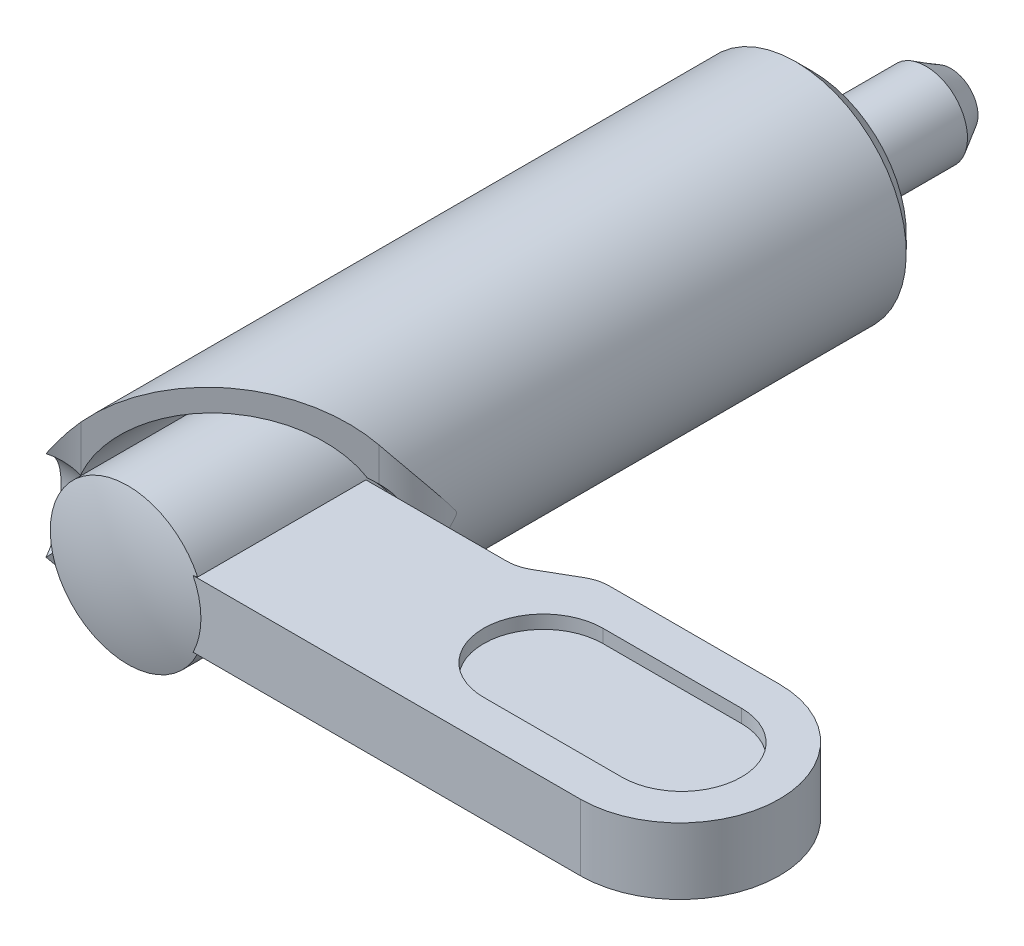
ISO-10303-21;
HEADER;
FILE_DESCRIPTION(('STEP AP214'),'2;1');
FILE_NAME('part.step','',(''),(''),'','','');
FILE_SCHEMA(('AUTOMOTIVE_DESIGN { 1 0 10303 214 1 1 1 1 }'));
ENDSEC;
DATA;
#1=APPLICATION_CONTEXT('core data for automotive mechanical design processes');
#2=APPLICATION_PROTOCOL_DEFINITION('international standard','automotive_design',2000,#1);
#3=PRODUCT_CONTEXT('',#1,'mechanical');
#4=PRODUCT('Part','Part','',(#3));
#5=PRODUCT_RELATED_PRODUCT_CATEGORY('part','',(#4));
#6=PRODUCT_DEFINITION_FORMATION('','',#4);
#7=PRODUCT_DEFINITION_CONTEXT('part definition',#1,'design');
#8=PRODUCT_DEFINITION('design','',#6,#7);
#9=PRODUCT_DEFINITION_SHAPE('','',#8);
#10=(LENGTH_UNIT() NAMED_UNIT(*) SI_UNIT(.MILLI.,.METRE.));
#11=(NAMED_UNIT(*) PLANE_ANGLE_UNIT() SI_UNIT($,.RADIAN.));
#12=(NAMED_UNIT(*) SI_UNIT($,.STERADIAN.) SOLID_ANGLE_UNIT());
#13=UNCERTAINTY_MEASURE_WITH_UNIT(LENGTH_MEASURE(1.E-05),#10,'distance_accuracy_value','');
#14=(GEOMETRIC_REPRESENTATION_CONTEXT(3) GLOBAL_UNCERTAINTY_ASSIGNED_CONTEXT((#13)) GLOBAL_UNIT_ASSIGNED_CONTEXT((#10,
#11,#12)) REPRESENTATION_CONTEXT('',''));
#15=CARTESIAN_POINT('',(0.,0.,0.));
#16=DIRECTION('',(0.,0.,1.));
#17=DIRECTION('',(1.,0.,0.));
#18=AXIS2_PLACEMENT_3D('',#15,#16,#17);
#19=CARTESIAN_POINT('',(-6.111214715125,32.,46.782847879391));
#20=DIRECTION('',(-0.606294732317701,0.,-0.795240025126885));
#21=DIRECTION('',(0.795240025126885,0.,-0.606294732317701));
#22=AXIS2_PLACEMENT_3D('',#19,#20,#21);
#23=PLANE('',#22);
#24=CARTESIAN_POINT('',(2.550610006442,0.,40.1790320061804));
#25=DIRECTION('',(-0.606294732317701,0.,-0.795240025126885));
#26=DIRECTION('',(-0.795240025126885,0.,0.606294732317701));
#27=AXIS2_PLACEMENT_3D('',#24,#25,#26);
#28=ELLIPSE('',#27,6.33355329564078,3.84000000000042);
#29=CARTESIAN_POINT('',(5.63382591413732,-3.03644620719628,37.82837370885));
#30=VERTEX_POINT('',#29);
#31=CARTESIAN_POINT('',(6.111214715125,-2.71595815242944,37.46441024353));
#32=VERTEX_POINT('',#31);
#33=EDGE_CURVE('E319',#30,#32,#28,.F.);
#34=ORIENTED_EDGE('',*,*,#33,.F.);
#35=CARTESIAN_POINT('',(0.,0.,42.1236290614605));
#36=DIRECTION('',(-0.606294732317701,0.,-0.795240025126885));
#37=DIRECTION('',(0.795240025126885,0.,-0.606294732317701));
#38=AXIS2_PLACEMENT_3D('',#35,#36,#37);
#39=ELLIPSE('',#38,8.04788466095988,6.4);
#40=CARTESIAN_POINT('',(-6.111214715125,-1.90080369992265,46.782847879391));
#41=VERTEX_POINT('',#40);
#42=EDGE_CURVE('E422',#30,#41,#39,.T.);
#43=ORIENTED_EDGE('',*,*,#42,.T.);
#44=DIRECTION('',(0.,-1.,0.));
#45=VECTOR('',#44,1.);
#46=CARTESIAN_POINT('',(-6.111214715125,32.,46.782847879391));
#47=LINE('',#46,#45);
#48=CARTESIAN_POINT('',(-6.111214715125,-5.16265965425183,46.782847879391));
#49=VERTEX_POINT('',#48);
#50=EDGE_CURVE('E431',#41,#49,#47,.T.);
#51=ORIENTED_EDGE('',*,*,#50,.T.);
#52=CARTESIAN_POINT('',(0.,0.,42.1236290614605));
#53=DIRECTION('',(-0.606294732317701,0.,-0.795240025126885));
#54=DIRECTION('',(0.795240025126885,0.,-0.606294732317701));
#55=AXIS2_PLACEMENT_3D('',#52,#53,#54);
#56=ELLIPSE('',#55,10.0598558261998,8.);
#57=CARTESIAN_POINT('',(6.111214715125,-5.16265965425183,37.46441024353));
#58=VERTEX_POINT('',#57);
#59=EDGE_CURVE('E451',#49,#58,#56,.F.);
#60=ORIENTED_EDGE('',*,*,#59,.T.);
#61=DIRECTION('',(0.,-1.,0.));
#62=VECTOR('',#61,1.);
#63=CARTESIAN_POINT('',(6.111214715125,32.,37.46441024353));
#64=LINE('',#63,#62);
#65=EDGE_CURVE('E427',#32,#58,#64,.T.);
#66=ORIENTED_EDGE('',*,*,#65,.F.);
#67=EDGE_LOOP('',(#34,#43,#51,#60,#66));
#68=FACE_BOUND('',#67,.T.);
#69=ADVANCED_FACE('F14',(#68),#23,.F.);
#70=CARTESIAN_POINT('',(3.20100000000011,32.,33.647258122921));
#71=DIRECTION('',(0.,-1.,0.));
#72=DIRECTION('',(1.,0.,0.));
#73=AXIS2_PLACEMENT_3D('',#70,#71,#72);
#74=CYLINDRICAL_SURFACE('',#73,4.79999999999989);
#75=CARTESIAN_POINT('',(6.111214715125,-2.71595815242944,37.46441024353));
#76=CARTESIAN_POINT('',(6.17056205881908,-2.67076879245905,37.4191825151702));
#77=CARTESIAN_POINT('',(6.22754131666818,-2.62287052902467,37.3735349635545));
#78=CARTESIAN_POINT('',(6.33655557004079,-2.52170275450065,37.2822693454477));
#79=CARTESIAN_POINT('',(6.38858992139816,-2.46843254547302,37.236651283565));
#80=CARTESIAN_POINT('',(6.48739955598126,-2.35668232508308,37.1464092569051));
#81=CARTESIAN_POINT('',(6.53418435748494,-2.29821209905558,37.1017836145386));
#82=CARTESIAN_POINT('',(6.62250899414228,-2.17620277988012,37.0143246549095));
#83=CARTESIAN_POINT('',(6.66404941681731,-2.11266425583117,36.9714911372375));
#84=CARTESIAN_POINT('',(6.74196353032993,-1.98072163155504,36.8883737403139));
#85=CARTESIAN_POINT('',(6.77832775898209,-1.91230895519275,36.8480946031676));
#86=CARTESIAN_POINT('',(6.84590535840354,-1.77112516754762,36.7709254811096));
#87=CARTESIAN_POINT('',(6.87711672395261,-1.69835237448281,36.7340368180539));
#88=CARTESIAN_POINT('',(6.93450895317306,-1.54903647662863,36.6643673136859));
#89=CARTESIAN_POINT('',(6.96069365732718,-1.47249630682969,36.6315833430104));
#90=CARTESIAN_POINT('',(7.00827152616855,-1.31612099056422,36.5706429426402));
#91=CARTESIAN_POINT('',(7.02966285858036,-1.23628459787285,36.5424882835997));
#92=CARTESIAN_POINT('',(7.06755165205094,-1.07521717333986,36.4916859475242));
#93=CARTESIAN_POINT('',(7.08412175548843,-0.994028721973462,36.4689575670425));
#94=CARTESIAN_POINT('',(7.11301230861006,-0.829609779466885,36.4287617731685));
#95=CARTESIAN_POINT('',(7.12533123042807,-0.746378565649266,36.4112962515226));
#96=CARTESIAN_POINT('',(7.15616310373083,-0.494442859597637,36.3671938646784));
#97=CARTESIAN_POINT('',(7.16856764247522,-0.323423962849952,36.3488281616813));
#98=CARTESIAN_POINT('',(7.17792604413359,0.0250726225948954,36.335031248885));
#99=CARTESIAN_POINT('',(7.17440085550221,0.202589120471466,36.3403110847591));
#100=CARTESIAN_POINT('',(7.15058349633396,0.554090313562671,36.3751201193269));
#101=CARTESIAN_POINT('',(7.13029371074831,0.72807550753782,36.4046458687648));
#102=CARTESIAN_POINT('',(7.0715272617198,1.06865519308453,36.4865473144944));
#103=CARTESIAN_POINT('',(7.03293193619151,1.23519359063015,36.5390719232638));
#104=CARTESIAN_POINT('',(6.93567669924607,1.55459525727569,36.6636110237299));
#105=CARTESIAN_POINT('',(6.87701902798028,1.70746005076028,36.7356233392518));
#106=CARTESIAN_POINT('',(6.73994159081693,1.99111383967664,36.8916926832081));
#107=CARTESIAN_POINT('',(6.66208689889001,2.12238060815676,36.9753798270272));
#108=CARTESIAN_POINT('',(6.48553667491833,2.36451981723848,37.1496973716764));
#109=CARTESIAN_POINT('',(6.38687083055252,2.47542089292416,37.2403177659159));
#110=CARTESIAN_POINT('',(6.25181009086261,2.60023753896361,37.3531710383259));
#111=CARTESIAN_POINT('',(6.2244711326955,2.62430003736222,37.375515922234));
#112=CARTESIAN_POINT('',(6.16868069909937,2.67110147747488,37.4200735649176));
#113=CARTESIAN_POINT('',(6.14023105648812,2.69384245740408,37.4422864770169));
#114=CARTESIAN_POINT('',(6.111214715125,2.71595815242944,37.46441024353));
#115=B_SPLINE_CURVE_WITH_KNOTS('',3,(#75,#76,#77,#78,#79,#80,#81,#82,#83,#84,#85,#86,#87,#88,
#89,#90,#91,#92,#93,#94,#95,#96,#97,#98,#99,#100,#101,#102,#103,#104,#105,#106,#107,#108,#109,
#110,#111,#112,#113,#114),.UNSPECIFIED.,.F.,.F.,(4,2,2,2,2,2,2,2,2,2,2,2,2,2,2,2,2,2,2,4),(0.,
0.261643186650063,0.523320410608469,0.784515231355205,1.04568076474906,1.30731774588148,
1.56905630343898,1.83059408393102,2.09223166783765,2.3496944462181,2.60724966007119,
3.12212982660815,3.65259521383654,4.18298514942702,4.71686122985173,5.25067771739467,
5.77034372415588,6.28927336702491,6.41743973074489,6.54540286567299),.UNSPECIFIED.);
#116=CARTESIAN_POINT('',(6.111214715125,2.71595815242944,37.46441024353));
#117=VERTEX_POINT('',#116);
#118=EDGE_CURVE('E311',#32,#117,#115,.T.);
#119=ORIENTED_EDGE('',*,*,#118,.F.);
#120=ORIENTED_EDGE('',*,*,#65,.T.);
#121=CARTESIAN_POINT('',(0.,8.,37.2240722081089));
#122=CARTESIAN_POINT('',(-0.0998530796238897,8.00000022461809,37.1347110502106));
#123=CARTESIAN_POINT('',(-0.195955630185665,7.99812938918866,37.0411697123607));
#124=CARTESIAN_POINT('',(-0.379987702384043,7.99150129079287,36.8463964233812));
#125=CARTESIAN_POINT('',(-0.467913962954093,7.9867428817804,36.7451614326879));
#126=CARTESIAN_POINT('',(-0.635067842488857,7.97519406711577,36.535609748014));
#127=CARTESIAN_POINT('',(-0.714282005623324,7.96840057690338,36.4272825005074));
#128=CARTESIAN_POINT('',(-0.863362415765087,7.95362938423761,36.2043935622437));
#129=CARTESIAN_POINT('',(-0.933224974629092,7.94565121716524,36.0898294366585));
#130=CARTESIAN_POINT('',(-1.06297904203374,7.92933443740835,35.8555113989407));
#131=CARTESIAN_POINT('',(-1.12289006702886,7.92099657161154,35.7357682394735));
#132=CARTESIAN_POINT('',(-1.2325300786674,7.90467864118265,35.4916340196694));
#133=CARTESIAN_POINT('',(-1.28225557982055,7.89669869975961,35.3672413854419));
#134=CARTESIAN_POINT('',(-1.37112117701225,7.88175470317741,35.1147741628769));
#135=CARTESIAN_POINT('',(-1.41026912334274,7.87478989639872,34.9867023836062));
#136=CARTESIAN_POINT('',(-1.47774242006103,7.86240773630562,34.7276662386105));
#137=CARTESIAN_POINT('',(-1.50606796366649,7.8569903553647,34.5967019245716));
#138=CARTESIAN_POINT('',(-1.55183492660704,7.84807984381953,34.3319006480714));
#139=CARTESIAN_POINT('',(-1.56920113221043,7.84460002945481,34.1980502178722));
#140=CARTESIAN_POINT('',(-1.5925990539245,7.83988337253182,33.929368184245));
#141=CARTESIAN_POINT('',(-1.59863463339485,7.83864576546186,33.7945369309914));
#142=CARTESIAN_POINT('',(-1.59933323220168,7.83850325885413,33.5248184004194));
#143=CARTESIAN_POINT('',(-1.59399411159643,7.83959879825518,33.3899311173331));
#144=CARTESIAN_POINT('',(-1.57198310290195,7.84404198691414,33.1211235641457));
#145=CARTESIAN_POINT('',(-1.55531132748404,7.84738961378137,32.987203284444));
#146=CARTESIAN_POINT('',(-1.51117738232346,7.85600642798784,32.7237323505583));
#147=CARTESIAN_POINT('',(-1.48391750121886,7.86123946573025,32.5941465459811));
#148=CARTESIAN_POINT('',(-1.41879665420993,7.87325291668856,32.3376817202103));
#149=CARTESIAN_POINT('',(-1.38093112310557,7.88003399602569,32.2108038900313));
#150=CARTESIAN_POINT('',(-1.29487457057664,7.89463125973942,31.96066195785));
#151=CARTESIAN_POINT('',(-1.24668348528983,7.90244745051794,31.8373978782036));
#152=CARTESIAN_POINT('',(-1.14030295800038,7.91849739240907,31.5952901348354));
#153=CARTESIAN_POINT('',(-1.08211337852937,7.92673114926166,31.4764465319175));
#154=CARTESIAN_POINT('',(-0.955027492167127,7.94305329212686,31.241946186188));
#155=CARTESIAN_POINT('',(-0.885963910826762,7.95113672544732,31.126379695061));
#156=CARTESIAN_POINT('',(-0.738366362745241,7.96619820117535,30.9014466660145));
#157=CARTESIAN_POINT('',(-0.65983604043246,7.97317666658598,30.7920777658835));
#158=CARTESIAN_POINT('',(-0.493771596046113,7.98518131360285,30.5802097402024));
#159=CARTESIAN_POINT('',(-0.406233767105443,7.9902066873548,30.4777134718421));
#160=CARTESIAN_POINT('',(-0.222829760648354,7.99742225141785,30.2804317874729));
#161=CARTESIAN_POINT('',(-0.126967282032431,7.99961369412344,30.1856429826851));
#162=CARTESIAN_POINT('',(0.0715198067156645,8.00029025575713,30.0052563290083));
#163=CARTESIAN_POINT('',(0.174077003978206,7.99880802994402,29.9195845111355));
#164=CARTESIAN_POINT('',(0.385833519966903,7.99139210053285,29.757189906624));
#165=CARTESIAN_POINT('',(0.495029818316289,7.9854604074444,29.6804630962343));
#166=CARTESIAN_POINT('',(0.719098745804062,7.96840720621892,29.5365541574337));
#167=CARTESIAN_POINT('',(0.833968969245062,7.95728788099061,29.4693680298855));
#168=CARTESIAN_POINT('',(1.0683267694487,7.92922435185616,29.345014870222));
#169=CARTESIAN_POINT('',(1.18781397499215,7.91228061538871,29.2878470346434));
#170=CARTESIAN_POINT('',(1.42108346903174,7.87359087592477,29.1877990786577));
#171=CARTESIAN_POINT('',(1.53462030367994,7.8523010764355,29.1441683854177));
#172=CARTESIAN_POINT('',(1.76362887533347,7.8040571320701,29.065925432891));
#173=CARTESIAN_POINT('',(1.87910124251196,7.77710110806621,29.0313161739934));
#174=CARTESIAN_POINT('',(2.11084112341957,7.71742566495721,28.9711616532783));
#175=CARTESIAN_POINT('',(2.2271081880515,7.68470927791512,28.9456116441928));
#176=CARTESIAN_POINT('',(2.45953229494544,7.6135063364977,28.9034008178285));
#177=CARTESIAN_POINT('',(2.57568928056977,7.57501765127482,28.8867432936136));
#178=CARTESIAN_POINT('',(2.80355385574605,7.49361718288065,28.8624086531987));
#179=CARTESIAN_POINT('',(2.91529283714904,7.45086590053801,28.8544852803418));
#180=CARTESIAN_POINT('',(3.13701141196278,7.36026549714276,28.8464022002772));
#181=CARTESIAN_POINT('',(3.24699031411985,7.31241442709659,28.8462454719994));
#182=CARTESIAN_POINT('',(3.4644906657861,7.21191079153,28.8532605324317));
#183=CARTESIAN_POINT('',(3.57201199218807,7.15925798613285,28.8604326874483));
#184=CARTESIAN_POINT('',(3.78406437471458,7.04947666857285,28.88161066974));
#185=CARTESIAN_POINT('',(3.88859480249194,6.99234722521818,28.8956179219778));
#186=CARTESIAN_POINT('',(4.13245206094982,6.85195636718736,28.9363307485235));
#187=CARTESIAN_POINT('',(4.27027368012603,6.76687361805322,28.965820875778));
#188=CARTESIAN_POINT('',(4.53867448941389,6.58986371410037,29.0353321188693));
#189=CARTESIAN_POINT('',(4.66925151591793,6.49793453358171,29.0753563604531));
#190=CARTESIAN_POINT('',(4.92283518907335,6.30799661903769,29.164694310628));
#191=CARTESIAN_POINT('',(5.04583156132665,6.20997998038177,29.2140202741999));
#192=CARTESIAN_POINT('',(5.28384647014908,6.00876593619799,29.3207388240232));
#193=CARTESIAN_POINT('',(5.39886266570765,5.90556702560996,29.3781337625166));
#194=CARTESIAN_POINT('',(5.66265905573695,5.65497190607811,29.5228650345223));
#195=CARTESIAN_POINT('',(5.80782997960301,5.5055752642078,29.6133340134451));
#196=CARTESIAN_POINT('',(6.08301233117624,5.19993122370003,29.8051038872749));
#197=CARTESIAN_POINT('',(6.21301824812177,5.0436813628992,29.9064086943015));
#198=CARTESIAN_POINT('',(6.45841964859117,4.72538521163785,30.1180216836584));
#199=CARTESIAN_POINT('',(6.57378934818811,4.56332931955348,30.2283452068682));
#200=CARTESIAN_POINT('',(6.79010087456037,4.23476354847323,30.4561722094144));
#201=CARTESIAN_POINT('',(6.89104275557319,4.06825368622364,30.5736756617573));
#202=CARTESIAN_POINT('',(7.11489929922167,3.66731444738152,30.8605098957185));
#203=CARTESIAN_POINT('',(7.23148136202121,3.43123368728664,31.0324946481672));
#204=CARTESIAN_POINT('',(7.43920503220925,2.95398054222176,31.3846426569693));
#205=CARTESIAN_POINT('',(7.53033550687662,2.71280597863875,31.5648094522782));
#206=CARTESIAN_POINT('',(7.68793983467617,2.22724420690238,31.9305898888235));
#207=CARTESIAN_POINT('',(7.75445309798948,1.982862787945,32.116194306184));
#208=CARTESIAN_POINT('',(7.86372040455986,1.4917100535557,32.4909168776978));
#209=CARTESIAN_POINT('',(7.90648367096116,1.24493970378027,32.6800336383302));
#210=CARTESIAN_POINT('',(7.95690174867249,0.843604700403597,32.9873269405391));
#211=CARTESIAN_POINT('',(7.97172376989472,0.689672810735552,33.1051238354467));
#212=CARTESIAN_POINT('',(7.98813143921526,0.444877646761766,33.2894942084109));
#213=CARTESIAN_POINT('',(7.99266153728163,0.354660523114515,33.3568155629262));
#214=CARTESIAN_POINT('',(7.99719398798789,0.2168310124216,33.4536846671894));
#215=CARTESIAN_POINT('',(7.99832742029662,0.170829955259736,33.4850652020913));
#216=CARTESIAN_POINT('',(7.99926967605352,0.108844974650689,33.5181697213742));
#217=CARTESIAN_POINT('',(7.99944001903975,0.0956228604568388,33.5247503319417));
#218=CARTESIAN_POINT('',(7.99971852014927,0.0684686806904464,33.5362108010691));
#219=CARTESIAN_POINT('',(7.99982696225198,0.0545401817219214,33.5410983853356));
#220=CARTESIAN_POINT('',(7.99994836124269,0.0303728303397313,33.5467557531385));
#221=CARTESIAN_POINT('',(7.99998054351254,0.0203369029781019,33.548334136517));
#222=CARTESIAN_POINT('',(8.00000631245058,0.000171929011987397,33.5495903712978));
#223=CARTESIAN_POINT('',(8.00000003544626,-0.00995666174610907,33.5492749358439));
#224=CARTESIAN_POINT('',(7.99994369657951,-0.0325579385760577,33.5465558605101));
#225=CARTESIAN_POINT('',(7.99988279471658,-0.044963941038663,33.5436362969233));
#226=CARTESIAN_POINT('',(7.9997096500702,-0.0692359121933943,33.5358931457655));
#227=CARTESIAN_POINT('',(7.99959692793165,-0.0810956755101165,33.5310518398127));
#228=CARTESIAN_POINT('',(7.99889430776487,-0.141929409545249,33.5034821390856));
#229=CARTESIAN_POINT('',(7.99793793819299,-0.187241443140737,33.4734226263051));
#230=CARTESIAN_POINT('',(7.99533695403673,-0.276609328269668,33.4118907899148));
#231=CARTESIAN_POINT('',(7.99368929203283,-0.320658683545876,33.3804127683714));
#232=CARTESIAN_POINT('',(7.98775187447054,-0.450982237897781,33.2854765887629));
#233=CARTESIAN_POINT('',(7.98245339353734,-0.536474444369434,33.2208133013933));
#234=CARTESIAN_POINT('',(7.96914726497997,-0.70708349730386,33.0912939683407));
#235=CARTESIAN_POINT('',(7.96113748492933,-0.792199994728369,33.0264378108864));
#236=CARTESIAN_POINT('',(7.9424197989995,-0.961899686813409,32.8967982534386));
#237=CARTESIAN_POINT('',(7.93171843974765,-1.04648367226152,32.8320150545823));
#238=CARTESIAN_POINT('',(7.90759762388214,-1.21538870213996,32.702653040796));
#239=CARTESIAN_POINT('',(7.89417846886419,-1.29970977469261,32.6380742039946));
#240=CARTESIAN_POINT('',(7.8342494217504,-1.64093350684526,32.3769389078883));
#241=CARTESIAN_POINT('',(7.77635039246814,-1.89685175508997,32.1815409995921));
#242=CARTESIAN_POINT('',(7.63435054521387,-2.40550767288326,31.7958518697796));
#243=CARTESIAN_POINT('',(7.550231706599,-2.65824303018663,31.6055642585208));
#244=CARTESIAN_POINT('',(7.35469981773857,-3.15923204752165,31.2324785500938));
#245=CARTESIAN_POINT('',(7.24325709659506,-3.40748051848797,31.0496888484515));
#246=CARTESIAN_POINT('',(6.99203487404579,-3.89707028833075,30.6950943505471));
#247=CARTESIAN_POINT('',(6.85227648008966,-4.13841658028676,30.523281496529));
#248=CARTESIAN_POINT('',(6.50867087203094,-4.66436237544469,30.157951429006));
#249=CARTESIAN_POINT('',(6.2974880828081,-4.94678809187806,29.9679821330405));
#250=CARTESIAN_POINT('',(5.94600566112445,-5.3551133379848,29.7069301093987));
#251=CARTESIAN_POINT('',(5.82313340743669,-5.48860376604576,29.6239335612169));
#252=CARTESIAN_POINT('',(5.56554836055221,-5.74963130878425,29.4673513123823));
#253=CARTESIAN_POINT('',(5.43083740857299,-5.87716934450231,29.3937641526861));
#254=CARTESIAN_POINT('',(5.18015829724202,-6.09815605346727,29.2725713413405));
#255=CARTESIAN_POINT('',(5.06646358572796,-6.19299796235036,29.2227924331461));
#256=CARTESIAN_POINT('',(4.83201441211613,-6.37760796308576,29.1311062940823));
#257=CARTESIAN_POINT('',(4.71126179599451,-6.46737736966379,29.0891970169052));
#258=CARTESIAN_POINT('',(4.46308546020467,-6.64106847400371,29.0143404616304));
#259=CARTESIAN_POINT('',(4.33566688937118,-6.72499457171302,28.9813863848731));
#260=CARTESIAN_POINT('',(4.07461643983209,-6.88629244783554,28.9255424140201));
#261=CARTESIAN_POINT('',(3.94098572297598,-6.9636654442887,28.9026506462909));
#262=CARTESIAN_POINT('',(3.69258220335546,-7.09796306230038,28.8711599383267));
#263=CARTESIAN_POINT('',(3.57868114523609,-7.15607736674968,28.860743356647));
#264=CARTESIAN_POINT('',(3.34785599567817,-7.26692798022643,28.8481137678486));
#265=CARTESIAN_POINT('',(3.23093251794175,-7.31966537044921,28.8458991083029));
#266=CARTESIAN_POINT('',(2.99485535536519,-7.41938362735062,28.8502344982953));
#267=CARTESIAN_POINT('',(2.87570251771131,-7.46636663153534,28.8567812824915));
#268=CARTESIAN_POINT('',(2.63603406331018,-7.55431111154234,28.8791037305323));
#269=CARTESIAN_POINT('',(2.51551842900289,-7.5952725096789,28.8948795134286));
#270=CARTESIAN_POINT('',(2.2736299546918,-7.6711631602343,28.9360903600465));
#271=CARTESIAN_POINT('',(2.15225568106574,-7.70606492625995,28.9615678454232));
#272=CARTESIAN_POINT('',(1.91032107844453,-7.76957625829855,29.0223577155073));
#273=CARTESIAN_POINT('',(1.7897607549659,-7.79818578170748,29.0576701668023));
#274=CARTESIAN_POINT('',(1.55063296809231,-7.84923476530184,29.1381336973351));
#275=CARTESIAN_POINT('',(1.43206551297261,-7.87167419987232,29.1832848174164));
#276=CARTESIAN_POINT('',(1.19808653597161,-7.91066720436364,29.2832552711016));
#277=CARTESIAN_POINT('',(1.08267487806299,-7.92722102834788,29.338074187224));
#278=CARTESIAN_POINT('',(0.864249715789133,-7.95388570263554,29.452773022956));
#279=CARTESIAN_POINT('',(0.760941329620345,-7.96437414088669,29.5120059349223));
#280=CARTESIAN_POINT('',(0.558740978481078,-7.98110918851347,29.6381842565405));
#281=CARTESIAN_POINT('',(0.459850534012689,-7.98735434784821,29.7051322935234));
#282=CARTESIAN_POINT('',(0.267261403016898,-7.99611549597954,29.8462808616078));
#283=CARTESIAN_POINT('',(0.173561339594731,-7.99863247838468,29.9204794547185));
#284=CARTESIAN_POINT('',(-0.00809034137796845,-8.00051185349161,30.0757009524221));
#285=CARTESIAN_POINT('',(-0.096039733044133,-7.99987303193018,30.1567264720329));
#286=CARTESIAN_POINT('',(-0.269203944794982,-7.99595798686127,30.3286460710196));
#287=CARTESIAN_POINT('',(-0.354146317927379,-7.99257149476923,30.4198124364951));
#288=CARTESIAN_POINT('',(-0.516657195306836,-7.98371409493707,30.6084186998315));
#289=CARTESIAN_POINT('',(-0.594222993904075,-7.97824242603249,30.7058608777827));
#290=CARTESIAN_POINT('',(-0.815131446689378,-7.95973720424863,31.0067105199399));
#291=CARTESIAN_POINT('',(-0.946793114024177,-7.94460935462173,31.2187484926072));
#292=CARTESIAN_POINT('',(-1.18389254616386,-7.91288922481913,31.6764946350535));
#293=CARTESIAN_POINT('',(-1.2867598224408,-7.89626992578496,31.9235278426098));
#294=CARTESIAN_POINT('',(-1.45014338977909,-7.86790974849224,32.4315244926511));
#295=CARTESIAN_POINT('',(-1.51066157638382,-7.85616865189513,32.6924873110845));
#296=CARTESIAN_POINT('',(-1.58780129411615,-7.84094983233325,33.2231853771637));
#297=CARTESIAN_POINT('',(-1.60407405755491,-7.83753778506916,33.4929734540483));
#298=CARTESIAN_POINT('',(-1.59117353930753,-7.84016589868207,34.0314092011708));
#299=CARTESIAN_POINT('',(-1.56200222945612,-7.84620564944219,34.3000569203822));
#300=CARTESIAN_POINT('',(-1.46004843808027,-7.86580288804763,34.8240182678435));
#301=CARTESIAN_POINT('',(-1.38798483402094,-7.87923618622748,35.0794778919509));
#302=CARTESIAN_POINT('',(-1.20281076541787,-7.90961361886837,35.5750424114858));
#303=CARTESIAN_POINT('',(-1.08968950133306,-7.92655867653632,35.8151432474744));
#304=CARTESIAN_POINT('',(-0.890418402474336,-7.95057898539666,36.1609250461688));
#305=CARTESIAN_POINT('',(-0.818223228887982,-7.95842111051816,36.2748112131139));
#306=CARTESIAN_POINT('',(-0.664476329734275,-7.97273082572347,36.4961557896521));
#307=CARTESIAN_POINT('',(-0.58292826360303,-7.97919895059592,36.6036166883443));
#308=CARTESIAN_POINT('',(-0.41098726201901,-7.9899003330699,36.8113924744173));
#309=CARTESIAN_POINT('',(-0.320591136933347,-7.99413278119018,36.9117047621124));
#310=CARTESIAN_POINT('',(-0.13165954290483,-7.9994743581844,37.1043624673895));
#311=CARTESIAN_POINT('',(-0.0331277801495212,-8.00058490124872,37.1967114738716));
#312=CARTESIAN_POINT('',(0.16983964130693,-7.99883109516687,37.3714674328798));
#313=CARTESIAN_POINT('',(0.274166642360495,-7.99602519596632,37.4540010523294));
#314=CARTESIAN_POINT('',(0.48911670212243,-7.98575813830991,37.6099987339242));
#315=CARTESIAN_POINT('',(0.599736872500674,-7.97829910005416,37.683466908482));
#316=CARTESIAN_POINT('',(0.826276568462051,-7.95802687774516,37.8207727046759));
#317=CARTESIAN_POINT('',(0.942193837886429,-7.94521595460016,37.8846143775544));
#318=CARTESIAN_POINT('',(1.17824502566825,-7.9136534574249,38.002237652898));
#319=CARTESIAN_POINT('',(1.29837861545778,-7.89490234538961,38.0560200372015));
#320=CARTESIAN_POINT('',(1.53230529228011,-7.85271073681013,38.1494895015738));
#321=CARTESIAN_POINT('',(1.64587853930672,-7.82973986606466,38.1899410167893));
#322=CARTESIAN_POINT('',(1.87460579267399,-7.77814884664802,38.2619147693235));
#323=CARTESIAN_POINT('',(1.98976030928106,-7.74952683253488,38.2934340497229));
#324=CARTESIAN_POINT('',(2.22053950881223,-7.68657939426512,38.3475494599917));
#325=CARTESIAN_POINT('',(2.33616394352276,-7.65225667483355,38.3701498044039));
#326=CARTESIAN_POINT('',(2.56700510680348,-7.57794139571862,38.4066396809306));
#327=CARTESIAN_POINT('',(2.68222166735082,-7.53794672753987,38.4205259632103));
#328=CARTESIAN_POINT('',(2.90902857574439,-7.45331495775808,38.4396941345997));
#329=CARTESIAN_POINT('',(3.02064543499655,-7.40878622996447,38.4451419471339));
#330=CARTESIAN_POINT('',(3.2418653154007,-7.31469702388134,38.4483608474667));
#331=CARTESIAN_POINT('',(3.35146754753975,-7.26513462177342,38.4461289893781));
#332=CARTESIAN_POINT('',(3.67627863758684,-7.10932230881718,38.4285807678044));
#333=CARTESIAN_POINT('',(3.88760031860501,-6.99590679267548,38.4024199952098));
#334=CARTESIAN_POINT('',(4.23386310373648,-6.78984194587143,38.3370591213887));
#335=CARTESIAN_POINT('',(4.37257215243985,-6.70128900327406,38.3041972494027));
#336=CARTESIAN_POINT('',(4.64234584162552,-6.51730598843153,38.2278868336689));
#337=CARTESIAN_POINT('',(4.77340806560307,-6.42187376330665,38.184434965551));
#338=CARTESIAN_POINT('',(5.15470715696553,-6.12636614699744,38.0400890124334));
#339=CARTESIAN_POINT('',(5.39282166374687,-5.91722146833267,37.9252530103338));
#340=CARTESIAN_POINT('',(5.76683202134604,-5.54886436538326,37.7077821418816));
#341=CARTESIAN_POINT('',(5.91161302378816,-5.39413031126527,37.6122958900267));
#342=CARTESIAN_POINT('',(6.18544702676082,-5.07779110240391,37.4104990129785));
#343=CARTESIAN_POINT('',(6.31449418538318,-4.91618342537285,37.3041843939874));
#344=CARTESIAN_POINT('',(6.55736652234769,-4.58724764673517,37.0826447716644));
#345=CARTESIAN_POINT('',(6.67116497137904,-4.41991012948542,36.9674046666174));
#346=CARTESIAN_POINT('',(6.88379422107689,-4.08085932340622,36.7298590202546));
#347=CARTESIAN_POINT('',(6.98262531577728,-3.90914612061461,36.607553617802));
#348=CARTESIAN_POINT('',(7.20009866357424,-3.49731913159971,36.3104587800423));
#349=CARTESIAN_POINT('',(7.31233444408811,-3.25563292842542,36.1331419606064));
#350=CARTESIAN_POINT('',(7.51073043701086,-2.76738521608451,35.7706764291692));
#351=CARTESIAN_POINT('',(7.59687770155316,-2.52082135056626,35.5855238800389));
#352=CARTESIAN_POINT('',(7.74386748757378,-2.02467503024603,35.2102541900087));
#353=CARTESIAN_POINT('',(7.80475011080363,-1.7750980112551,35.0201454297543));
#354=CARTESIAN_POINT('',(7.90205699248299,-1.27387074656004,34.6366927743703));
#355=CARTESIAN_POINT('',(7.93849775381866,-1.0222220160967,34.4433511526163));
#356=CARTESIAN_POINT('',(7.97508892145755,-0.643356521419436,34.1546772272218));
#357=CARTESIAN_POINT('',(7.98427365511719,-0.517176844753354,34.0589311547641));
#358=CARTESIAN_POINT('',(7.99372899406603,-0.323675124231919,33.9156414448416));
#359=CARTESIAN_POINT('',(7.99616239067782,-0.25731519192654,33.8671202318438));
#360=CARTESIAN_POINT('',(7.99819222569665,-0.170907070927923,33.8118146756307));
#361=CARTESIAN_POINT('',(7.99854696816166,-0.153493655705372,33.8010448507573));
#362=CARTESIAN_POINT('',(7.99915200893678,-0.11785011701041,33.7808059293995));
#363=CARTESIAN_POINT('',(7.99940223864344,-0.0996194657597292,33.7713376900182));
#364=CARTESIAN_POINT('',(7.99969733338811,-0.0703460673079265,33.7591670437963));
#365=CARTESIAN_POINT('',(7.99978387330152,-0.0597908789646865,33.7553431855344));
#366=CARTESIAN_POINT('',(7.99991562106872,-0.0382708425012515,33.7493263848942));
#367=CARTESIAN_POINT('',(7.99996111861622,-0.0273094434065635,33.7471220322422));
#368=CARTESIAN_POINT('',(8.00000630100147,-0.00497944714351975,33.7449326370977));
#369=CARTESIAN_POINT('',(8.0000053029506,0.00639276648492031,33.744980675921));
#370=CARTESIAN_POINT('',(7.99995572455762,0.0289219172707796,33.7473842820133));
#371=CARTESIAN_POINT('',(7.99990690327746,0.0400774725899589,33.7497515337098));
#372=CARTESIAN_POINT('',(7.99968891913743,0.0743517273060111,33.7596171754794));
#373=CARTESIAN_POINT('',(7.99944599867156,0.0965859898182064,33.7698880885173));
#374=CARTESIAN_POINT('',(7.99880683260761,0.139859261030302,33.7928292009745));
#375=CARTESIAN_POINT('',(7.99840886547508,0.160881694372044,33.8055254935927));
#376=CARTESIAN_POINT('',(7.99684970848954,0.229569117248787,33.8490869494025));
#377=CARTESIAN_POINT('',(7.99537232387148,0.275990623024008,33.8819287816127));
#378=CARTESIAN_POINT('',(7.99165642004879,0.368145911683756,33.9485203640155));
#379=CARTESIAN_POINT('',(7.9894168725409,0.413878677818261,33.9822712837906));
#380=CARTESIAN_POINT('',(7.98419422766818,0.504679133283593,34.0499855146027));
#381=CARTESIAN_POINT('',(7.98121633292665,0.549749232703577,34.0839457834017));
#382=CARTESIAN_POINT('',(7.97451118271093,0.639687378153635,34.152000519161));
#383=CARTESIAN_POINT('',(7.97078431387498,0.68455551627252,34.1860949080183));
#384=CARTESIAN_POINT('',(7.95015845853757,0.909867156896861,34.3576261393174));
#385=CARTESIAN_POINT('',(7.92753871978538,1.08953982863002,34.4954504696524));
#386=CARTESIAN_POINT('',(7.86997349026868,1.44790138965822,34.7699413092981));
#387=CARTESIAN_POINT('',(7.83502238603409,1.62658979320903,34.9066072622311));
#388=CARTESIAN_POINT('',(7.7524595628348,1.98317570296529,35.1784145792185));
#389=CARTESIAN_POINT('',(7.70480641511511,2.16106864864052,35.3135494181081));
#390=CARTESIAN_POINT('',(7.59662964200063,2.51504668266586,35.5809720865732));
#391=CARTESIAN_POINT('',(7.53610760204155,2.69113199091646,35.7132602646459));
#392=CARTESIAN_POINT('',(7.40168266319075,3.04144353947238,35.9744649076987));
#393=CARTESIAN_POINT('',(7.32774685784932,3.21566406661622,36.1033721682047));
#394=CARTESIAN_POINT('',(7.16618550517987,3.56120280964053,36.3564737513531));
#395=CARTESIAN_POINT('',(7.07855878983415,3.73252077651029,36.4806676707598));
#396=CARTESIAN_POINT('',(6.88924630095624,4.07135140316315,36.7230442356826));
#397=CARTESIAN_POINT('',(6.78757428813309,4.23886760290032,36.8412326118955));
#398=CARTESIAN_POINT('',(6.56967350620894,4.56930651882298,37.070271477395));
#399=CARTESIAN_POINT('',(6.45344758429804,4.73223012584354,37.1811233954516));
#400=CARTESIAN_POINT('',(6.12902796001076,5.15195314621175,37.4599579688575));
#401=CARTESIAN_POINT('',(5.90851382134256,5.40428140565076,37.6207158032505));
#402=CARTESIAN_POINT('',(5.4266163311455,5.88796481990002,37.9093469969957));
#403=CARTESIAN_POINT('',(5.16527567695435,6.11934149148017,38.0372543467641));
#404=CARTESIAN_POINT('',(4.66181041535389,6.50737898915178,38.2256992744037));
#405=CARTESIAN_POINT('',(4.42720983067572,6.6695179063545,38.2947489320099));
#406=CARTESIAN_POINT('',(4.05924476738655,6.89516562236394,38.3715713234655));
#407=CARTESIAN_POINT('',(3.93393286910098,6.96744499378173,38.3927189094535));
#408=CARTESIAN_POINT('',(3.67855040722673,7.1055823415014,38.4251754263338));
#409=CARTESIAN_POINT('',(3.54848055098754,7.17144126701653,38.4364858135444));
#410=CARTESIAN_POINT('',(3.30417355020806,7.28682965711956,38.4474670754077));
#411=CARTESIAN_POINT('',(3.19045983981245,7.33733081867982,38.4486192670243));
#412=CARTESIAN_POINT('',(2.96098845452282,7.43289883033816,38.4426268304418));
#413=CARTESIAN_POINT('',(2.84523108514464,7.47796648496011,38.4354834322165));
#414=CARTESIAN_POINT('',(2.61251240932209,7.56241369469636,38.4124813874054));
#415=CARTESIAN_POINT('',(2.49555116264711,7.6017935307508,38.3966231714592));
#416=CARTESIAN_POINT('',(2.26137177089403,7.67471406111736,38.3558908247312));
#417=CARTESIAN_POINT('',(2.14415362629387,7.70825476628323,38.3310167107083));
#418=CARTESIAN_POINT('',(1.91012984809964,7.76956115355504,38.2720024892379));
#419=CARTESIAN_POINT('',(1.79332659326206,7.79730875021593,38.2378341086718));
#420=CARTESIAN_POINT('',(1.56157079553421,7.84700854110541,38.1602619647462));
#421=CARTESIAN_POINT('',(1.44661821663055,7.86896084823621,38.1168583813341));
#422=CARTESIAN_POINT('',(1.21970768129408,7.90730950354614,38.021002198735));
#423=CARTESIAN_POINT('',(1.10774740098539,7.9237102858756,37.9685568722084));
#424=CARTESIAN_POINT('',(0.887759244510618,7.9513630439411,37.8548993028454));
#425=CARTESIAN_POINT('',(0.779730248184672,7.96261649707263,37.7936895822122));
#426=CARTESIAN_POINT('',(0.554865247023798,7.98163138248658,37.6544556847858));
#427=CARTESIAN_POINT('',(0.438686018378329,7.98875669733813,37.5752812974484));
#428=CARTESIAN_POINT('',(0.213629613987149,7.99794040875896,37.4069608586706));
#429=CARTESIAN_POINT('',(0.104751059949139,7.99999976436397,37.3178166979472));
#430=CARTESIAN_POINT('',(0.,8.,37.2240722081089));
#431=B_SPLINE_CURVE_WITH_KNOTS('',3,(#121,#122,#123,#124,#125,#126,#127,#128,#129,#130,#131,
#132,#133,#134,#135,#136,#137,#138,#139,#140,#141,#142,#143,#144,#145,#146,#147,#148,#149,#150,
#151,#152,#153,#154,#155,#156,#157,#158,#159,#160,#161,#162,#163,#164,#165,#166,#167,#168,#169,
#170,#171,#172,#173,#174,#175,#176,#177,#178,#179,#180,#181,#182,#183,#184,#185,#186,#187,#188,
#189,#190,#191,#192,#193,#194,#195,#196,#197,#198,#199,#200,#201,#202,#203,#204,#205,#206,#207,
#208,#209,#210,#211,#212,#213,#214,#215,#216,#217,#218,#219,#220,#221,#222,#223,#224,#225,#226,
#227,#228,#229,#230,#231,#232,#233,#234,#235,#236,#237,#238,#239,#240,#241,#242,#243,#244,#245,
#246,#247,#248,#249,#250,#251,#252,#253,#254,#255,#256,#257,#258,#259,#260,#261,#262,#263,#264,
#265,#266,#267,#268,#269,#270,#271,#272,#273,#274,#275,#276,#277,#278,#279,#280,#281,#282,#283,
#284,#285,#286,#287,#288,#289,#290,#291,#292,#293,#294,#295,#296,#297,#298,#299,#300,#301,#302,
#303,#304,#305,#306,#307,#308,#309,#310,#311,#312,#313,#314,#315,#316,#317,#318,#319,#320,#321,
#322,#323,#324,#325,#326,#327,#328,#329,#330,#331,#332,#333,#334,#335,#336,#337,#338,#339,#340,
#341,#342,#343,#344,#345,#346,#347,#348,#349,#350,#351,#352,#353,#354,#355,#356,#357,#358,#359,
#360,#361,#362,#363,#364,#365,#366,#367,#368,#369,#370,#371,#372,#373,#374,#375,#376,#377,#378,
#379,#380,#381,#382,#383,#384,#385,#386,#387,#388,#389,#390,#391,#392,#393,#394,#395,#396,#397,
#398,#399,#400,#401,#402,#403,#404,#405,#406,#407,#408,#409,#410,#411,#412,#413,#414,#415,#416,
#417,#418,#419,#420,#421,#422,#423,#424,#425,#426,#427,#428,#429,#430),.UNSPECIFIED.,.T.,.F.,(4,
2,2,2,2,2,2,2,2,2,2,2,2,2,2,2,2,2,2,2,2,2,2,2,2,2,2,2,2,2,2,2,2,2,2,2,2,2,2,2,2,2,2,2,2,2,2,2,2,
2,2,2,2,2,2,2,2,2,2,2,2,2,2,2,2,2,2,2,2,2,2,2,2,2,2,2,2,2,2,2,2,2,2,2,2,2,2,2,2,2,2,2,2,2,2,2,2,
2,2,2,2,2,2,2,2,2,2,2,2,2,2,2,2,2,2,2,2,2,2,2,2,2,2,2,2,2,2,2,2,2,2,2,2,2,2,2,2,2,2,2,2,2,2,2,2,
2,2,2,2,2,2,2,2,2,4),(0.,0.401864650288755,0.803888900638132,1.20652560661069,1.60932064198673,
2.01131616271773,2.41344901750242,2.81528259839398,3.21710900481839,3.62166397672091,
4.02608098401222,4.43057408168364,4.83506315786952,5.23217700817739,5.62946205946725,
6.02674956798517,6.42404253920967,6.82818417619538,7.23217072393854,7.6363241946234,
8.04029899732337,8.44069576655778,8.8409117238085,9.24095942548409,9.64097502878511,
10.0109499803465,10.3810478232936,10.7509514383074,11.1209919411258,11.4803089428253,
11.839763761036,12.1992365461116,12.5587843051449,13.0519509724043,13.5452641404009,
14.0392318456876,14.5333438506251,15.213653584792,15.8942097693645,16.5759486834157,
17.2576850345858,18.1997996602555,19.1423257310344,20.0833362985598,21.0239811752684,
21.6068134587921,21.9450201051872,22.1116058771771,22.1558686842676,22.1999267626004,
22.230254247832,22.2604742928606,22.2984622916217,22.3368089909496,22.4988299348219,
22.6615727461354,22.9832754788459,23.3052318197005,23.6264125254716,23.9475576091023,
24.9278233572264,25.9087643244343,26.8907752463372,27.8720568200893,29.0693501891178,
29.6673721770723,30.2653013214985,30.7335215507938,31.201619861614,31.6693617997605,
32.1370166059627,32.5215185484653,32.90594302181,33.2902242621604,33.6745104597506,
34.0604966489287,34.446485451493,34.8324758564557,35.2184495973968,35.5766799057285,
35.935032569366,36.2932897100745,36.6516847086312,37.0252189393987,37.3988896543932,
38.1457791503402,38.9464419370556,39.7470688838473,40.553988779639,41.3608736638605,
42.1546015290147,42.9485383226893,43.3533491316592,43.7580020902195,44.1628014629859,
44.5674174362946,44.9660589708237,45.3645189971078,45.7628108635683,46.1610717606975,
46.5288050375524,46.8966599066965,47.2643407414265,47.6321586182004,47.9926480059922,
48.353275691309,49.074186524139,49.5770228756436,50.0800172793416,51.0868309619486,
51.7833266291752,52.4800801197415,53.1780393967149,53.875984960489,54.8348556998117,
55.7942015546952,56.7520187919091,57.7091886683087,58.1852222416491,58.4316793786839,
58.4931034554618,58.55456778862,58.5881717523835,58.6215366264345,58.6553916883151,
58.6894181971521,58.7622971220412,58.8360094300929,59.0064624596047,59.1771463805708,
59.3466601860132,59.5160867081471,60.1984206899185,60.8810656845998,61.5659650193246,
62.2507800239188,62.9372982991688,63.6238751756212,64.3097840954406,64.9955590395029,
66.1068079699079,67.2169024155,68.0934573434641,68.5316001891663,68.9696781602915,
69.3425814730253,69.7154295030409,70.0882591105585,70.4610880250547,70.8350640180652,
71.2090327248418,71.5827020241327,71.9562640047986,72.3779206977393,72.7994975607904),.UNSPECIFIED.);
#432=CARTESIAN_POINT('',(6.111214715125,5.16265965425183,37.46441024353));
#433=VERTEX_POINT('',#432);
#434=EDGE_CURVE('E450',#58,#433,#431,.T.);
#435=ORIENTED_EDGE('',*,*,#434,.T.);
#436=EDGE_CURVE('E423',#433,#117,#64,.T.);
#437=ORIENTED_EDGE('',*,*,#436,.T.);
#438=EDGE_LOOP('',(#119,#120,#435,#437));
#439=FACE_BOUND('',#438,.T.);
#440=ADVANCED_FACE('F321',(#439),#74,.T.);
#441=CARTESIAN_POINT('',(2.550610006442,0.,40.1790320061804));
#442=DIRECTION('',(-0.606294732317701,0.,-0.795240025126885));
#443=DIRECTION('',(-0.795240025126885,0.,0.606294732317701));
#444=AXIS2_PLACEMENT_3D('',#441,#442,#443);
#445=ELLIPSE('',#444,6.33355329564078,3.84000000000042);
#446=CARTESIAN_POINT('',(5.63382591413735,3.03644620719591,37.8283737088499));
#447=VERTEX_POINT('',#446);
#448=EDGE_CURVE('E309',#117,#447,#445,.F.);
#449=ORIENTED_EDGE('',*,*,#448,.F.);
#450=ORIENTED_EDGE('',*,*,#436,.F.);
#451=CARTESIAN_POINT('',(-6.111214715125,5.16265965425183,46.782847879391));
#452=VERTEX_POINT('',#451);
#453=EDGE_CURVE('E447',#433,#452,#56,.F.);
#454=ORIENTED_EDGE('',*,*,#453,.T.);
#455=CARTESIAN_POINT('',(-6.111214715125,1.90080369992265,46.782847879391));
#456=VERTEX_POINT('',#455);
#457=EDGE_CURVE('E428',#452,#456,#47,.T.);
#458=ORIENTED_EDGE('',*,*,#457,.T.);
#459=EDGE_CURVE('E419',#456,#447,#39,.T.);
#460=ORIENTED_EDGE('',*,*,#459,.T.);
#461=EDGE_LOOP('',(#449,#450,#454,#458,#460));
#462=FACE_BOUND('',#461,.T.);
#463=ADVANCED_FACE('F357',(#462),#23,.F.);
#464=CARTESIAN_POINT('',(0.,0.,32.));
#465=DIRECTION('',(0.,0.,-1.));
#466=DIRECTION('',(0.,1.,0.));
#467=AXIS2_PLACEMENT_3D('',#464,#465,#466);
#468=CYLINDRICAL_SURFACE('',#467,6.4);
#469=CARTESIAN_POINT('',(0.,0.,32.));
#470=DIRECTION('',(0.,0.,-1.));
#471=DIRECTION('',(0.,1.,0.));
#472=AXIS2_PLACEMENT_3D('',#469,#470,#471);
#473=CIRCLE('',#472,6.4);
#474=CARTESIAN_POINT('',(0.,6.4,32.));
#475=VERTEX_POINT('',#474);
#476=EDGE_CURVE('E416',#475,#475,#473,.T.);
#477=ORIENTED_EDGE('',*,*,#476,.T.);
#478=EDGE_LOOP('',(#477));
#479=FACE_BOUND('',#478,.T.);
#480=CARTESIAN_POINT('',(5.44705424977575,3.36,38.32));
#481=CARTESIAN_POINT('',(5.480730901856,3.30541549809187,38.2213616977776));
#482=CARTESIAN_POINT('',(5.51580027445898,3.24671813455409,38.1255097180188));
#483=CARTESIAN_POINT('',(5.58761410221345,3.12149897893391,37.9397450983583));
#484=CARTESIAN_POINT('',(5.62435830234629,3.05497837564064,37.8498315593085));
#485=CARTESIAN_POINT('',(5.69858615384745,2.91418647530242,37.6758964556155));
#486=CARTESIAN_POINT('',(5.7360723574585,2.83988219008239,37.5919027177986));
#487=CARTESIAN_POINT('',(5.81059764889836,2.6841029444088,37.4306211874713));
#488=CARTESIAN_POINT('',(5.84763671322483,2.60262760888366,37.3533337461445));
#489=CARTESIAN_POINT('',(5.92031125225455,2.43278704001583,37.2058511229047));
#490=CARTESIAN_POINT('',(5.95594566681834,2.34441674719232,37.1356612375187));
#491=CARTESIAN_POINT('',(6.02483738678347,2.16122831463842,37.0029524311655));
#492=CARTESIAN_POINT('',(6.05809495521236,2.06641089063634,36.9404326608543));
#493=CARTESIAN_POINT('',(6.1212927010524,1.87091260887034,36.8237035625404));
#494=CARTESIAN_POINT('',(6.15123713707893,1.77023953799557,36.769483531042));
#495=CARTESIAN_POINT('',(6.20698550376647,1.56357706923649,36.6699052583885));
#496=CARTESIAN_POINT('',(6.23279221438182,1.45759130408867,36.6245410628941));
#497=CARTESIAN_POINT('',(6.27807367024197,1.24764079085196,36.5457437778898));
#498=CARTESIAN_POINT('',(6.29783928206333,1.1439493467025,36.511750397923));
#499=CARTESIAN_POINT('',(6.33247727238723,0.933333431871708,36.4525800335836));
#500=CARTESIAN_POINT('',(6.34735227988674,0.826410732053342,36.4273983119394));
#501=CARTESIAN_POINT('',(6.37176753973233,0.610248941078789,36.3862366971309));
#502=CARTESIAN_POINT('',(6.38130991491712,0.501010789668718,36.3702531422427));
#503=CARTESIAN_POINT('',(6.39476568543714,0.281224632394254,36.3477514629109));
#504=CARTESIAN_POINT('',(6.39867982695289,0.170676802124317,36.3412320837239));
#505=CARTESIAN_POINT('',(6.40061784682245,-0.0357822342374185,36.3380024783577));
#506=CARTESIAN_POINT('',(6.39936048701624,-0.131670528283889,36.3400953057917));
#507=CARTESIAN_POINT('',(6.39256524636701,-0.322901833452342,36.3514333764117));
#508=CARTESIAN_POINT('',(6.38702604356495,-0.418244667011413,36.3606808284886));
#509=CARTESIAN_POINT('',(6.37180015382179,-0.607598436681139,36.386204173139));
#510=CARTESIAN_POINT('',(6.36211566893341,-0.701610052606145,36.4024763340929));
#511=CARTESIAN_POINT('',(6.33883115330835,-0.88771365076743,36.4418369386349));
#512=CARTESIAN_POINT('',(6.32522961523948,-0.979804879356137,36.4649280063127));
#513=CARTESIAN_POINT('',(6.27957400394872,-1.24879504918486,36.5430384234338));
#514=CARTESIAN_POINT('',(6.24234354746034,-1.4222036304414,36.6074235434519));
#515=CARTESIAN_POINT('',(6.15687972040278,-1.75573005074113,36.7589927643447));
#516=CARTESIAN_POINT('',(6.10864009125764,-1.9158402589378,36.8461898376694));
#517=CARTESIAN_POINT('',(5.99901769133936,-2.23685984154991,37.0513896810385));
#518=CARTESIAN_POINT('',(5.93677912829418,-2.3960003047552,37.1716980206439));
#519=CARTESIAN_POINT('',(5.80815013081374,-2.69287351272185,37.4343434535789));
#520=CARTESIAN_POINT('',(5.74176091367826,-2.83061249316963,37.576674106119));
#521=CARTESIAN_POINT('',(5.6364875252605,-3.03271668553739,37.8205514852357));
#522=CARTESIAN_POINT('',(5.59714959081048,-3.10449923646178,37.9158505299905));
#523=CARTESIAN_POINT('',(5.52037311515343,-3.23905567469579,38.113043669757));
#524=CARTESIAN_POINT('',(5.48293130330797,-3.30184544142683,38.2149256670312));
#525=CARTESIAN_POINT('',(5.44705424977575,-3.36,38.32));
#526=B_SPLINE_CURVE_WITH_KNOTS('',3,(#480,#481,#482,#483,#484,#485,#486,#487,#488,#489,#490,
#491,#492,#493,#494,#495,#496,#497,#498,#499,#500,#501,#502,#503,#504,#505,#506,#507,#508,#509,
#510,#511,#512,#513,#514,#515,#516,#517,#518,#519,#520,#521,#522,#523,#524,#525),.UNSPECIFIED.,
.F.,.F.,(4,2,2,2,2,2,2,2,2,2,2,2,2,2,2,2,2,2,2,2,2,2,4),(0.,0.352816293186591,0.705579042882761,
1.05990246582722,1.41424443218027,1.76884890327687,2.12341407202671,2.47751806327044,
2.83138314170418,3.16359080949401,3.49561960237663,3.8275161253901,4.15936864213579,
4.44677013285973,4.73426039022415,5.02159811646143,5.30904656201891,5.87255322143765,
6.43638102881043,7.06089653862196,7.68522974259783,8.06164814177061,8.43739344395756),.UNSPECIFIED.);
#527=EDGE_CURVE('E338',#447,#30,#526,.T.);
#528=ORIENTED_EDGE('',*,*,#527,.F.);
#529=ORIENTED_EDGE('',*,*,#459,.F.);
#530=CARTESIAN_POINT('',(-6.111214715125,-1.90080369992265,46.782847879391));
#531=CARTESIAN_POINT('',(-6.15300808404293,-1.76646448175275,46.8147317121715));
#532=CARTESIAN_POINT('',(-6.19052397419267,-1.63019813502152,46.8444026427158));
#533=CARTESIAN_POINT('',(-6.25668378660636,-1.35426478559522,46.8980197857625));
#534=CARTESIAN_POINT('',(-6.28531757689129,-1.2145940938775,46.9219594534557));
#535=CARTESIAN_POINT('',(-6.33323296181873,-0.933005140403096,46.9626800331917));
#536=CARTESIAN_POINT('',(-6.35254029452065,-0.791094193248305,46.9794806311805));
#537=CARTESIAN_POINT('',(-6.38160690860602,-0.505630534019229,47.0049866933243));
#538=CARTESIAN_POINT('',(-6.39137068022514,-0.362078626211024,47.0136959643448));
#539=CARTESIAN_POINT('',(-6.40121581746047,-0.0735030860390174,47.022477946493));
#540=CARTESIAN_POINT('',(-6.40123835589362,0.0715241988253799,47.0224981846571));
#541=CARTESIAN_POINT('',(-6.3914513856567,0.361013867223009,47.0137678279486));
#542=CARTESIAN_POINT('',(-6.38163929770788,0.505476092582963,47.0050149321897));
#543=CARTESIAN_POINT('',(-6.35238248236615,0.792479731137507,46.9793423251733));
#544=CARTESIAN_POINT('',(-6.33295005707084,0.935023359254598,46.962433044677));
#545=CARTESIAN_POINT('',(-6.28477420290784,1.2174251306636,46.9215043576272));
#546=CARTESIAN_POINT('',(-6.25603444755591,1.35728431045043,46.8974877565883));
#547=CARTESIAN_POINT('',(-6.20637437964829,1.56393086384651,46.8572509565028));
#548=CARTESIAN_POINT('',(-6.18882487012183,1.6319832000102,46.8432108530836));
#549=CARTESIAN_POINT('',(-6.15160394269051,1.76710737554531,46.8139075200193));
#550=CARTESIAN_POINT('',(-6.13193624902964,1.83418070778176,46.7986464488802));
#551=CARTESIAN_POINT('',(-6.111214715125,1.90080369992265,46.782847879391));
#552=B_SPLINE_CURVE_WITH_KNOTS('',3,(#530,#531,#532,#533,#534,#535,#536,#537,#538,#539,#540,
#541,#542,#543,#544,#545,#546,#547,#548,#549,#550,#551),.UNSPECIFIED.,.F.,.F.,(4,2,2,2,2,2,2,2,
2,2,4),(0.,0.432781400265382,0.866054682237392,1.29812533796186,1.72999260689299,
2.16446788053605,2.59905713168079,3.03309207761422,3.46695592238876,3.681917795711,
3.89650770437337),.UNSPECIFIED.);
#553=CARTESIAN_POINT('',(-6.13423380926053,1.82515083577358,46.8005080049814));
#554=VERTEX_POINT('',#553);
#555=EDGE_CURVE('E370',#554,#456,#552,.T.);
#556=ORIENTED_EDGE('',*,*,#555,.F.);
#557=CARTESIAN_POINT('',(-5.96125681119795,2.32882314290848,47.1258070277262));
#558=CARTESIAN_POINT('',(-5.99189613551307,2.25041592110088,47.0659996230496));
#559=CARTESIAN_POINT('',(-6.02172178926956,2.16948291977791,47.0090494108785));
#560=CARTESIAN_POINT('',(-6.07917198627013,2.00285093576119,46.9012219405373));
#561=CARTESIAN_POINT('',(-6.10679511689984,1.91714895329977,46.8503485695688));
#562=CARTESIAN_POINT('',(-6.15934094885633,1.74097983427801,46.7549016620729));
#563=CARTESIAN_POINT('',(-6.18425127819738,1.6504934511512,46.7103567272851));
#564=CARTESIAN_POINT('',(-6.23066469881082,1.46557158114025,46.6282672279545));
#565=CARTESIAN_POINT('',(-6.25216845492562,1.37113686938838,46.5907212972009));
#566=CARTESIAN_POINT('',(-6.29134477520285,1.17842701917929,46.5228879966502));
#567=CARTESIAN_POINT('',(-6.30899995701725,1.0801367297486,46.492633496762));
#568=CARTESIAN_POINT('',(-6.33990293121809,0.880795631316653,46.4399915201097));
#569=CARTESIAN_POINT('',(-6.35315109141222,0.779745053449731,46.4176033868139));
#570=CARTESIAN_POINT('',(-6.37485700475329,0.575913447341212,46.3810565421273));
#571=CARTESIAN_POINT('',(-6.38332641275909,0.473137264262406,46.366877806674));
#572=CARTESIAN_POINT('',(-6.39528657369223,0.266491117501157,46.3468844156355));
#573=CARTESIAN_POINT('',(-6.39877781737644,0.16262126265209,46.3410689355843));
#574=CARTESIAN_POINT('',(-6.40060608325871,-0.0367483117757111,46.3380219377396));
#575=CARTESIAN_POINT('',(-6.39934279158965,-0.132234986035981,46.3401247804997));
#576=CARTESIAN_POINT('',(-6.39257119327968,-0.322667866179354,46.3514235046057));
#577=CARTESIAN_POINT('',(-6.38706147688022,-0.417613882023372,46.3606217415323));
#578=CARTESIAN_POINT('',(-6.37192080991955,-0.606286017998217,46.3860016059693));
#579=CARTESIAN_POINT('',(-6.36228774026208,-0.700011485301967,46.4021868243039));
#580=CARTESIAN_POINT('',(-6.33912820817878,-0.885558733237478,46.4413334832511));
#581=CARTESIAN_POINT('',(-6.32560033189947,-0.97737980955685,46.4642973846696));
#582=CARTESIAN_POINT('',(-6.28008099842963,-1.24626957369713,46.542163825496));
#583=CARTESIAN_POINT('',(-6.2428917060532,-1.41983177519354,46.6064669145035));
#584=CARTESIAN_POINT('',(-6.15751067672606,-1.75349781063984,46.7578585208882));
#585=CARTESIAN_POINT('',(-6.10932870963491,-1.91361342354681,46.8449268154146));
#586=CARTESIAN_POINT('',(-6.04198585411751,-2.11109187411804,46.9709510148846));
#587=CARTESIAN_POINT('',(-6.0262115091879,-2.15568171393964,47.0007452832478));
#588=CARTESIAN_POINT('',(-5.99412278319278,-2.2433594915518,47.0620159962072));
#589=CARTESIAN_POINT('',(-5.97780943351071,-2.28645000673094,47.0934892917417));
#590=CARTESIAN_POINT('',(-5.96125681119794,-2.32882314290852,47.1258070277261));
#591=B_SPLINE_CURVE_WITH_KNOTS('',3,(#557,#558,#559,#560,#561,#562,#563,#564,#565,#566,#567,
#568,#569,#570,#571,#572,#573,#574,#575,#576,#577,#578,#579,#580,#581,#582,#583,#584,#585,#586,
#587,#588,#589,#590),.UNSPECIFIED.,.F.,.F.,(4,2,2,2,2,2,2,2,2,2,2,2,2,2,2,2,4),(0.,
0.309750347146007,0.619697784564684,0.931004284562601,1.24224995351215,1.55487352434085,
1.86747099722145,2.17930274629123,2.49110375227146,2.77730201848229,3.06359533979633,
3.35003597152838,3.63658071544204,4.20046242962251,4.76384492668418,4.93151314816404,
5.09887726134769),.UNSPECIFIED.);
#592=CARTESIAN_POINT('',(-6.13423380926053,-1.82515083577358,46.8005080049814));
#593=VERTEX_POINT('',#592);
#594=EDGE_CURVE('E346',#554,#593,#591,.T.);
#595=ORIENTED_EDGE('',*,*,#594,.T.);
#596=EDGE_CURVE('E362',#41,#593,#552,.T.);
#597=ORIENTED_EDGE('',*,*,#596,.F.);
#598=ORIENTED_EDGE('',*,*,#42,.F.);
#599=EDGE_LOOP('',(#528,#529,#556,#595,#597,#598));
#600=FACE_BOUND('',#599,.T.);
#601=ADVANCED_FACE('F353',(#479,#600),#468,.F.);
#602=CARTESIAN_POINT('',(-3.20100000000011,32.,50.6));
#603=DIRECTION('',(0.,-1.,0.));
#604=DIRECTION('',(1.,0.,0.));
#605=AXIS2_PLACEMENT_3D('',#602,#603,#604);
#606=CYLINDRICAL_SURFACE('',#605,4.79999999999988);
#607=ORIENTED_EDGE('',*,*,#596,.T.);
#608=CARTESIAN_POINT('',(-6.111214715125,-1.7920751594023,46.782847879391));
#609=CARTESIAN_POINT('',(-6.15444727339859,-1.85451301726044,46.8158038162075));
#610=CARTESIAN_POINT('',(-6.1981811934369,-1.91575775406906,46.8503131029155));
#611=CARTESIAN_POINT('',(-6.28624444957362,-2.03594946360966,46.9224331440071));
#612=CARTESIAN_POINT('',(-6.33057377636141,-2.09489647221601,46.9600438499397));
#613=CARTESIAN_POINT('',(-6.46401611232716,-2.2686480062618,47.0776718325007));
#614=CARTESIAN_POINT('',(-6.55341480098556,-2.3801245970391,47.1623587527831));
#615=CARTESIAN_POINT('',(-6.72814781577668,-2.59144795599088,47.3419989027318));
#616=CARTESIAN_POINT('',(-6.81352814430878,-2.69151087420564,47.4366541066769));
#617=CARTESIAN_POINT('',(-6.98029699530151,-2.88227298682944,47.6379135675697));
#618=CARTESIAN_POINT('',(-7.06169099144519,-2.97298522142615,47.7445007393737));
#619=CARTESIAN_POINT('',(-7.1778304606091,-3.09960552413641,47.9112853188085));
#620=CARTESIAN_POINT('',(-7.21487708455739,-3.13953814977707,47.9668739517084));
#621=CARTESIAN_POINT('',(-7.28757185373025,-3.21703825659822,48.0811626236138));
#622=CARTESIAN_POINT('',(-7.32321057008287,-3.25459056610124,48.1398789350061));
#623=CARTESIAN_POINT('',(-7.35792193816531,-3.29074950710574,48.2));
#624=B_SPLINE_CURVE_WITH_KNOTS('',3,(#608,#609,#610,#611,#612,#613,#614,#615,#616,#617,#618,
#619,#620,#621,#622,#623),.UNSPECIFIED.,.F.,.F.,(4,2,2,2,2,2,2,4),(0.,0.248299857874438,
0.496595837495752,0.994138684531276,1.4796415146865,1.96445784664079,2.19784603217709,
2.43259698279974),.UNSPECIFIED.);
#625=CARTESIAN_POINT('',(-7.31292158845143,-3.24363651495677,48.1236920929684));
#626=VERTEX_POINT('',#625);
#627=EDGE_CURVE('E403',#593,#626,#624,.T.);
#628=ORIENTED_EDGE('',*,*,#627,.T.);
#629=CARTESIAN_POINT('',(-7.35792193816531,-3.14022049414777,48.2));
#630=CARTESIAN_POINT('',(-7.28262780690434,-3.31660029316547,48.0696349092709));
#631=CARTESIAN_POINT('',(-7.20042601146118,-3.49168073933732,47.9413795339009));
#632=CARTESIAN_POINT('',(-7.02218811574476,-3.83752437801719,47.6910361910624));
#633=CARTESIAN_POINT('',(-6.92622719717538,-4.00830545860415,47.56891928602));
#634=CARTESIAN_POINT('',(-6.71964778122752,-4.34574123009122,47.3313763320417));
#635=CARTESIAN_POINT('',(-6.60902635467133,-4.51239508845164,47.2159516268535));
#636=CARTESIAN_POINT('',(-6.37202634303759,-4.84133525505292,46.9929064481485));
#637=CARTESIAN_POINT('',(-6.24556734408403,-5.00359373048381,46.885330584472));
#638=CARTESIAN_POINT('',(-6.11121471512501,-5.16265965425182,46.782847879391));
#639=B_SPLINE_CURVE_WITH_KNOTS('',3,(#629,#630,#631,#632,#633,#634,#635,#636,#637,#638),
.UNSPECIFIED.,.F.,.F.,(4,2,2,2,4),(0.,0.695658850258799,1.38765196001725,2.07978353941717,
2.77558380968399),.UNSPECIFIED.);
#640=EDGE_CURVE('E371',#626,#49,#639,.T.);
#641=ORIENTED_EDGE('',*,*,#640,.T.);
#642=ORIENTED_EDGE('',*,*,#50,.F.);
#643=EDGE_LOOP('',(#607,#628,#641,#642));
#644=FACE_BOUND('',#643,.T.);
#645=ADVANCED_FACE('F356',(#644),#606,.F.);
#646=CARTESIAN_POINT('',(0.,0.,-10.));
#647=DIRECTION('',(0.,0.,-1.));
#648=DIRECTION('',(0.,1.,0.));
#649=AXIS2_PLACEMENT_3D('',#646,#647,#648);
#650=CYLINDRICAL_SURFACE('',#649,8.);
#651=CARTESIAN_POINT('',(-7.2918425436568,3.29074950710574,48.2));
#652=CARTESIAN_POINT('',(-7.31757332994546,3.23373122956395,48.105202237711));
#653=CARTESIAN_POINT('',(-7.34427720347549,3.1727774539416,48.0131118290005));
#654=CARTESIAN_POINT('',(-7.3988431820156,3.04336293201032,47.8347416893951));
#655=CARTESIAN_POINT('',(-7.42670518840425,2.97490282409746,47.7484614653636));
#656=CARTESIAN_POINT('',(-7.51094836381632,2.75854999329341,47.4986253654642));
#657=CARTESIAN_POINT('',(-7.56789446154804,2.59987976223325,47.3443969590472));
#658=CARTESIAN_POINT('',(-7.67705012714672,2.25724535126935,47.0646557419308));
#659=CARTESIAN_POINT('',(-7.72925631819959,2.07326336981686,46.9391633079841));
#660=CARTESIAN_POINT('',(-7.79968303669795,1.78185094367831,46.7756451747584));
#661=CARTESIAN_POINT('',(-7.8218448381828,1.68214028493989,46.7252592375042));
#662=CARTESIAN_POINT('',(-7.8629394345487,1.47816703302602,46.6331720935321));
#663=CARTESIAN_POINT('',(-7.88187378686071,1.37390666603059,46.5914666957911));
#664=CARTESIAN_POINT('',(-7.91525732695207,1.16590971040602,46.5187180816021));
#665=CARTESIAN_POINT('',(-7.92985786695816,1.06232497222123,46.4873095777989));
#666=CARTESIAN_POINT('',(-7.95515312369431,0.852466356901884,46.4332834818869));
#667=CARTESIAN_POINT('',(-7.96584972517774,0.746193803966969,46.4106616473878));
#668=CARTESIAN_POINT('',(-7.98303005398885,0.531786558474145,46.3744791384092));
#669=CARTESIAN_POINT('',(-7.98951407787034,0.423651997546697,46.3609178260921));
#670=CARTESIAN_POINT('',(-7.99807394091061,0.206450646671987,46.3430380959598));
#671=CARTESIAN_POINT('',(-8.00015011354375,0.0973839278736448,46.3387189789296));
#672=CARTESIAN_POINT('',(-7.99984703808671,-0.110978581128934,46.3393509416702));
#673=CARTESIAN_POINT('',(-7.99784859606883,-0.210278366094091,46.3435096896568));
#674=CARTESIAN_POINT('',(-7.99019529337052,-0.408149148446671,46.3594940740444));
#675=CARTESIAN_POINT('',(-7.98453924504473,-0.506719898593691,46.3713222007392));
#676=CARTESIAN_POINT('',(-7.9697132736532,-0.702340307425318,46.4025099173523));
#677=CARTESIAN_POINT('',(-7.96054530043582,-0.799390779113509,46.4218653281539));
#678=CARTESIAN_POINT('',(-7.9389246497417,-0.991378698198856,46.4678960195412));
#679=CARTESIAN_POINT('',(-7.92647072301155,-1.08631532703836,46.4945740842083));
#680=CARTESIAN_POINT('',(-7.88477365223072,-1.36585576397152,46.5848498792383));
#681=CARTESIAN_POINT('',(-7.85108646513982,-1.54654342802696,46.6589091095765));
#682=CARTESIAN_POINT('',(-7.77480252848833,-1.89316489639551,46.8325103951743));
#683=CARTESIAN_POINT('',(-7.73219867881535,-2.05908679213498,46.9320727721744));
#684=CARTESIAN_POINT('',(-7.63790920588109,-2.38613106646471,47.163189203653));
#685=CARTESIAN_POINT('',(-7.58576480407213,-2.5457358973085,47.296701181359));
#686=CARTESIAN_POINT('',(-7.48019474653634,-2.8409943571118,47.5872841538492));
#687=CARTESIAN_POINT('',(-7.42677110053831,-2.97668307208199,47.7443200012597));
#688=CARTESIAN_POINT('',(-7.36106237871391,-3.1330712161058,47.9580402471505));
#689=CARTESIAN_POINT('',(-7.34689917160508,-3.16611669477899,48.0054058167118));
#690=CARTESIAN_POINT('',(-7.31901657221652,-3.23004742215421,48.1016013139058));
#691=CARTESIAN_POINT('',(-7.30529660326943,-3.26093554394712,48.1504291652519));
#692=CARTESIAN_POINT('',(-7.2918425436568,-3.29074950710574,48.2));
#693=B_SPLINE_CURVE_WITH_KNOTS('',3,(#651,#652,#653,#654,#655,#656,#657,#658,#659,#660,#661,
#662,#663,#664,#665,#666,#667,#668,#669,#670,#671,#672,#673,#674,#675,#676,#677,#678,#679,#680,
#681,#682,#683,#684,#685,#686,#687,#688,#689,#690,#691,#692),.UNSPECIFIED.,.F.,.F.,(4,2,2,2,2,2,
2,2,2,2,2,2,2,2,2,2,2,2,2,2,4),(0.,0.340508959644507,0.680988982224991,1.36309931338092,
2.04569184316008,2.38698773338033,2.72811845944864,3.0553453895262,3.38241413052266,
3.70945984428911,4.03648081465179,4.33433936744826,4.63229468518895,4.93008481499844,
5.22798832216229,5.819719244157,6.41192315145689,7.05284165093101,7.69281192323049,
7.87116804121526,8.04928191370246),.UNSPECIFIED.);
#694=CARTESIAN_POINT('',(-7.31292158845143,3.24363651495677,48.1236920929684));
#695=VERTEX_POINT('',#694);
#696=EDGE_CURVE('E410',#695,#626,#693,.T.);
#697=ORIENTED_EDGE('',*,*,#696,.F.);
#698=CARTESIAN_POINT('',(-6.111214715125,5.16265965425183,46.782847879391));
#699=CARTESIAN_POINT('',(-6.24556734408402,5.00359373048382,46.885330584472));
#700=CARTESIAN_POINT('',(-6.37202634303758,4.84133525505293,46.9929064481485));
#701=CARTESIAN_POINT('',(-6.60902635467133,4.51239508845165,47.2159516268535));
#702=CARTESIAN_POINT('',(-6.71964778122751,4.34574123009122,47.3313763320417));
#703=CARTESIAN_POINT('',(-6.92622719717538,4.00830545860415,47.56891928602));
#704=CARTESIAN_POINT('',(-7.02218811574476,3.83752437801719,47.6910361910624));
#705=CARTESIAN_POINT('',(-7.20042601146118,3.49168073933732,47.9413795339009));
#706=CARTESIAN_POINT('',(-7.28262780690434,3.31660029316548,48.0696349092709));
#707=CARTESIAN_POINT('',(-7.35792193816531,3.14022049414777,48.2));
#708=B_SPLINE_CURVE_WITH_KNOTS('',3,(#698,#699,#700,#701,#702,#703,#704,#705,#706,#707),
.UNSPECIFIED.,.F.,.F.,(4,2,2,2,4),(0.,0.695800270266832,1.38793184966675,2.0799249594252,
2.77558380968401),.UNSPECIFIED.);
#709=EDGE_CURVE('E387',#452,#695,#708,.T.);
#710=ORIENTED_EDGE('',*,*,#709,.F.);
#711=ORIENTED_EDGE('',*,*,#453,.F.);
#712=ORIENTED_EDGE('',*,*,#434,.F.);
#713=ORIENTED_EDGE('',*,*,#59,.F.);
#714=ORIENTED_EDGE('',*,*,#640,.F.);
#715=EDGE_LOOP('',(#697,#710,#711,#712,#713,#714));
#716=FACE_BOUND('',#715,.T.);
#717=CARTESIAN_POINT('',(0.,0.,1.227));
#718=DIRECTION('',(0.,0.,-1.));
#719=DIRECTION('',(0.,1.,0.));
#720=AXIS2_PLACEMENT_3D('',#717,#718,#719);
#721=CIRCLE('',#720,8.);
#722=CARTESIAN_POINT('',(0.,8.,1.227));
#723=VERTEX_POINT('',#722);
#724=EDGE_CURVE('E442',#723,#723,#721,.T.);
#725=ORIENTED_EDGE('',*,*,#724,.F.);
#726=EDGE_LOOP('',(#725));
#727=FACE_BOUND('',#726,.T.);
#728=ADVANCED_FACE('F16',(#716,#727),#650,.T.);
#729=CARTESIAN_POINT('',(0.,0.,0.));
#730=DIRECTION('',(0.,0.,1.));
#731=DIRECTION('',(0.,-1.,0.));
#732=AXIS2_PLACEMENT_3D('',#729,#730,#731);
#733=CONICAL_SURFACE('',#732,6.773,0.785398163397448);
#734=ORIENTED_EDGE('',*,*,#724,.T.);
#735=EDGE_LOOP('',(#734));
#736=FACE_BOUND('',#735,.T.);
#737=CARTESIAN_POINT('',(0.,0.,0.));
#738=DIRECTION('',(0.,0.,-1.));
#739=DIRECTION('',(0.,1.,0.));
#740=AXIS2_PLACEMENT_3D('',#737,#738,#739);
#741=CIRCLE('',#740,6.773);
#742=CARTESIAN_POINT('',(0.,6.773,0.));
#743=VERTEX_POINT('',#742);
#744=EDGE_CURVE('E440',#743,#743,#741,.T.);
#745=ORIENTED_EDGE('',*,*,#744,.F.);
#746=EDGE_LOOP('',(#745));
#747=FACE_BOUND('',#746,.T.);
#748=ADVANCED_FACE('F494',(#736,#747),#733,.T.);
#749=CARTESIAN_POINT('',(6.773,0.,0.));
#750=DIRECTION('',(0.,0.,-1.));
#751=DIRECTION('',(0.,1.,0.));
#752=AXIS2_PLACEMENT_3D('',#749,#750,#751);
#753=PLANE('',#752);
#754=ORIENTED_EDGE('',*,*,#744,.T.);
#755=EDGE_LOOP('',(#754));
#756=FACE_BOUND('',#755,.T.);
#757=CARTESIAN_POINT('',(0.,0.,0.));
#758=DIRECTION('',(0.,0.,-1.));
#759=DIRECTION('',(0.,1.,0.));
#760=AXIS2_PLACEMENT_3D('',#757,#758,#759);
#761=CIRCLE('',#760,3.);
#762=CARTESIAN_POINT('',(0.,3.,0.));
#763=VERTEX_POINT('',#762);
#764=EDGE_CURVE('E437',#763,#763,#761,.T.);
#765=ORIENTED_EDGE('',*,*,#764,.F.);
#766=EDGE_LOOP('',(#765));
#767=FACE_BOUND('',#766,.T.);
#768=ADVANCED_FACE('F499',(#756,#767),#753,.T.);
#769=CARTESIAN_POINT('',(0.,0.,-10.));
#770=DIRECTION('',(0.,0.,-1.));
#771=DIRECTION('',(0.,1.,0.));
#772=AXIS2_PLACEMENT_3D('',#769,#770,#771);
#773=CYLINDRICAL_SURFACE('',#772,3.);
#774=ORIENTED_EDGE('',*,*,#764,.T.);
#775=EDGE_LOOP('',(#774));
#776=FACE_BOUND('',#775,.T.);
#777=CARTESIAN_POINT('',(0.,0.,-8.2));
#778=DIRECTION('',(0.,0.,-1.));
#779=DIRECTION('',(0.,1.,0.));
#780=AXIS2_PLACEMENT_3D('',#777,#778,#779);
#781=CIRCLE('',#780,3.);
#782=CARTESIAN_POINT('',(0.,3.,-8.2));
#783=VERTEX_POINT('',#782);
#784=EDGE_CURVE('E434',#783,#783,#781,.T.);
#785=ORIENTED_EDGE('',*,*,#784,.F.);
#786=EDGE_LOOP('',(#785));
#787=FACE_BOUND('',#786,.T.);
#788=ADVANCED_FACE('F504',(#776,#787),#773,.T.);
#789=CARTESIAN_POINT('',(0.,0.,-10.));
#790=DIRECTION('',(0.,0.,1.));
#791=DIRECTION('',(0.,-1.,0.));
#792=AXIS2_PLACEMENT_3D('',#789,#790,#791);
#793=CONICAL_SURFACE('',#792,1.9607695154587,0.523598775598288);
#794=ORIENTED_EDGE('',*,*,#784,.T.);
#795=EDGE_LOOP('',(#794));
#796=FACE_BOUND('',#795,.T.);
#797=CARTESIAN_POINT('',(0.,0.,-10.));
#798=DIRECTION('',(0.,0.,-1.));
#799=DIRECTION('',(0.,1.,0.));
#800=AXIS2_PLACEMENT_3D('',#797,#798,#799);
#801=CIRCLE('',#800,1.9607695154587);
#802=CARTESIAN_POINT('',(0.,1.9607695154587,-10.));
#803=VERTEX_POINT('',#802);
#804=EDGE_CURVE('E426',#803,#803,#801,.T.);
#805=ORIENTED_EDGE('',*,*,#804,.F.);
#806=EDGE_LOOP('',(#805));
#807=FACE_BOUND('',#806,.T.);
#808=ADVANCED_FACE('F510',(#796,#807),#793,.T.);
#809=CARTESIAN_POINT('',(1.9607695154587,0.,-10.));
#810=DIRECTION('',(0.,0.,-1.));
#811=DIRECTION('',(0.,1.,0.));
#812=AXIS2_PLACEMENT_3D('',#809,#810,#811);
#813=PLANE('',#812);
#814=ORIENTED_EDGE('',*,*,#804,.T.);
#815=EDGE_LOOP('',(#814));
#816=FACE_BOUND('',#815,.T.);
#817=ADVANCED_FACE('F381',(#816),#813,.T.);
#818=ORIENTED_EDGE('',*,*,#709,.T.);
#819=CARTESIAN_POINT('',(-7.35792193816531,3.29074950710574,48.2));
#820=CARTESIAN_POINT('',(-7.32097361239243,3.25225972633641,48.1360043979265));
#821=CARTESIAN_POINT('',(-7.28297491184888,3.21219246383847,48.0736012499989));
#822=CARTESIAN_POINT('',(-7.2051630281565,3.12911582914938,47.9520028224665));
#823=CARTESIAN_POINT('',(-7.16535048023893,3.08610748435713,47.892806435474));
#824=CARTESIAN_POINT('',(-7.04367124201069,2.9530462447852,47.720124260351));
#825=CARTESIAN_POINT('',(-6.95948000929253,2.85887111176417,47.611403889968));
#826=CARTESIAN_POINT('',(-6.78905499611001,2.66298631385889,47.4089172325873));
#827=CARTESIAN_POINT('',(-6.70290359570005,2.5614812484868,47.3148805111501));
#828=CARTESIAN_POINT('',(-6.52900837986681,2.34984385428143,47.1388388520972));
#829=CARTESIAN_POINT('',(-6.4412652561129,2.2397152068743,47.0568288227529));
#830=CARTESIAN_POINT('',(-6.31321598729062,2.0718367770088,46.9452709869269));
#831=CARTESIAN_POINT('',(-6.27253405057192,2.01742896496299,46.9110447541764));
#832=CARTESIAN_POINT('',(-6.1914941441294,1.90638588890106,46.8450440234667));
#833=CARTESIAN_POINT('',(-6.15113889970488,1.84974064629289,46.8132829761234));
#834=CARTESIAN_POINT('',(-6.111214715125,1.7920751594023,46.782847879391));
#835=B_SPLINE_CURVE_WITH_KNOTS('',3,(#819,#820,#821,#822,#823,#824,#825,#826,#827,#828,#829,
#830,#831,#832,#833,#834),.UNSPECIFIED.,.F.,.F.,(4,2,2,2,2,2,2,4),(0.,0.249871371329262,
0.499655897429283,0.998672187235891,1.48699951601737,1.97511950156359,2.2032701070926,
2.43258888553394),.UNSPECIFIED.);
#836=EDGE_CURVE('E397',#695,#554,#835,.T.);
#837=ORIENTED_EDGE('',*,*,#836,.T.);
#838=ORIENTED_EDGE('',*,*,#555,.T.);
#839=ORIENTED_EDGE('',*,*,#457,.F.);
#840=EDGE_LOOP('',(#818,#837,#838,#839));
#841=FACE_BOUND('',#840,.T.);
#842=ADVANCED_FACE('F377',(#841),#606,.F.);
#843=CARTESIAN_POINT('',(6.4,0.,32.));
#844=DIRECTION('',(0.,0.,-1.));
#845=DIRECTION('',(0.,1.,0.));
#846=AXIS2_PLACEMENT_3D('',#843,#844,#845);
#847=PLANE('',#846);
#848=CARTESIAN_POINT('',(0.,0.,32.));
#849=DIRECTION('',(0.,0.,-1.));
#850=DIRECTION('',(0.,1.,0.));
#851=AXIS2_PLACEMENT_3D('',#848,#849,#850);
#852=CIRCLE('',#851,5.6);
#853=CARTESIAN_POINT('',(0.,5.6,32.));
#854=VERTEX_POINT('',#853);
#855=EDGE_CURVE('E303',#854,#854,#852,.T.);
#856=ORIENTED_EDGE('',*,*,#855,.T.);
#857=EDGE_LOOP('',(#856));
#858=FACE_BOUND('',#857,.T.);
#859=ORIENTED_EDGE('',*,*,#476,.F.);
#860=EDGE_LOOP('',(#859));
#861=FACE_BOUND('',#860,.T.);
#862=ADVANCED_FACE('F359',(#858,#861),#847,.F.);
#863=CARTESIAN_POINT('',(-8.5,0.,50.1790320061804));
#864=DIRECTION('',(1.,0.,0.));
#865=DIRECTION('',(0.,1.,0.));
#866=AXIS2_PLACEMENT_3D('',#863,#864,#865);
#867=CYLINDRICAL_SURFACE('',#866,3.84000000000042);
#868=ORIENTED_EDGE('',*,*,#696,.T.);
#869=ORIENTED_EDGE('',*,*,#627,.F.);
#870=ORIENTED_EDGE('',*,*,#594,.F.);
#871=ORIENTED_EDGE('',*,*,#836,.F.);
#872=EDGE_LOOP('',(#868,#869,#870,#871));
#873=FACE_BOUND('',#872,.T.);
#874=ADVANCED_FACE('F331',(#873),#867,.F.);
#875=CARTESIAN_POINT('',(8.5,0.,40.1790320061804));
#876=DIRECTION('',(-1.,0.,0.));
#877=DIRECTION('',(0.,-1.,0.));
#878=AXIS2_PLACEMENT_3D('',#875,#876,#877);
#879=CYLINDRICAL_SURFACE('',#878,3.84000000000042);
#880=ORIENTED_EDGE('',*,*,#33,.T.);
#881=ORIENTED_EDGE('',*,*,#118,.T.);
#882=ORIENTED_EDGE('',*,*,#448,.T.);
#883=ORIENTED_EDGE('',*,*,#527,.T.);
#884=EDGE_LOOP('',(#880,#881,#882,#883));
#885=FACE_BOUND('',#884,.T.);
#886=ADVANCED_FACE('F325',(#885),#879,.F.);
#887=CARTESIAN_POINT('',(-2.98112229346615E-12,0.,31.9999999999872));
#888=DIRECTION('',(0.,0.,-1.));
#889=DIRECTION('',(1.,0.,0.));
#890=AXIS2_PLACEMENT_3D('',#887,#888,#889);
#891=SPHERICAL_SURFACE('',#890,18.4000000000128);
#892=CARTESIAN_POINT('',(-2.98112229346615E-12,2.4,31.9999999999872));
#893=DIRECTION('',(0.,1.,0.));
#894=DIRECTION('',(-1.,0.,0.));
#895=AXIS2_PLACEMENT_3D('',#892,#893,#894);
#896=CIRCLE('',#895,18.2428068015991);
#897=CARTESIAN_POINT('',(5.05964425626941,2.4,49.527121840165));
#898=VERTEX_POINT('',#897);
#899=CARTESIAN_POINT('',(4.79999999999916,2.4,49.6));
#900=VERTEX_POINT('',#899);
#901=EDGE_CURVE('E301',#898,#900,#896,.F.);
#902=ORIENTED_EDGE('',*,*,#901,.F.);
#903=CARTESIAN_POINT('',(0.,0.,49.527121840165));
#904=DIRECTION('',(0.,0.,-1.));
#905=DIRECTION('',(0.,1.,0.));
#906=AXIS2_PLACEMENT_3D('',#903,#904,#905);
#907=CIRCLE('',#906,5.6);
#908=CARTESIAN_POINT('',(5.05964425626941,-2.4,49.527121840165));
#909=VERTEX_POINT('',#908);
#910=EDGE_CURVE('E306',#909,#898,#907,.T.);
#911=ORIENTED_EDGE('',*,*,#910,.F.);
#912=CARTESIAN_POINT('',(-2.98112229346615E-12,-2.4,31.9999999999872));
#913=DIRECTION('',(0.,1.,0.));
#914=DIRECTION('',(-1.,0.,0.));
#915=AXIS2_PLACEMENT_3D('',#912,#913,#914);
#916=CIRCLE('',#915,18.2428068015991);
#917=CARTESIAN_POINT('',(4.79999999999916,-2.4,49.6));
#918=VERTEX_POINT('',#917);
#919=EDGE_CURVE('E288',#909,#918,#916,.F.);
#920=ORIENTED_EDGE('',*,*,#919,.T.);
#921=CARTESIAN_POINT('',(-2.98112229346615E-12,0.,49.6));
#922=DIRECTION('',(0.,0.,1.));
#923=DIRECTION('',(0.,-1.,0.));
#924=AXIS2_PLACEMENT_3D('',#921,#922,#923);
#925=CIRCLE('',#924,5.36656314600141);
#926=EDGE_CURVE('E9',#900,#918,#925,.F.);
#927=ORIENTED_EDGE('',*,*,#926,.F.);
#928=EDGE_LOOP('',(#902,#911,#920,#927));
#929=FACE_BOUND('',#928,.T.);
#930=ADVANCED_FACE('F330',(#929),#891,.T.);
#931=CARTESIAN_POINT('',(0.,0.,1.));
#932=DIRECTION('',(0.,0.,-1.));
#933=DIRECTION('',(0.,1.,0.));
#934=AXIS2_PLACEMENT_3D('',#931,#932,#933);
#935=CYLINDRICAL_SURFACE('',#934,5.6);
#936=DIRECTION('',(0.,0.,-1.));
#937=VECTOR('',#936,1.);
#938=CARTESIAN_POINT('',(5.05964425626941,2.4,1.));
#939=LINE('',#938,#937);
#940=CARTESIAN_POINT('',(5.05964425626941,2.4,37.36));
#941=VERTEX_POINT('',#940);
#942=EDGE_CURVE('E23',#941,#898,#939,.F.);
#943=ORIENTED_EDGE('',*,*,#942,.F.);
#944=CARTESIAN_POINT('',(0.,0.,37.36));
#945=DIRECTION('',(0.,0.,-1.));
#946=DIRECTION('',(0.,1.,0.));
#947=AXIS2_PLACEMENT_3D('',#944,#945,#946);
#948=CIRCLE('',#947,5.6);
#949=CARTESIAN_POINT('',(5.05964425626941,-2.4,37.36));
#950=VERTEX_POINT('',#949);
#951=EDGE_CURVE('E822',#950,#941,#948,.F.);
#952=ORIENTED_EDGE('',*,*,#951,.F.);
#953=DIRECTION('',(0.,0.,-1.));
#954=VECTOR('',#953,1.);
#955=CARTESIAN_POINT('',(5.05964425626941,-2.4,1.));
#956=LINE('',#955,#954);
#957=EDGE_CURVE('E345',#950,#909,#956,.F.);
#958=ORIENTED_EDGE('',*,*,#957,.T.);
#959=ORIENTED_EDGE('',*,*,#910,.T.);
#960=EDGE_LOOP('',(#943,#952,#958,#959));
#961=FACE_BOUND('',#960,.T.);
#962=ORIENTED_EDGE('',*,*,#855,.F.);
#963=EDGE_LOOP('',(#962));
#964=FACE_BOUND('',#963,.T.);
#965=ADVANCED_FACE('F560',(#961,#964),#935,.T.);
#966=CARTESIAN_POINT('',(32.8,2.4,49.6));
#967=DIRECTION('',(0.,0.,1.));
#968=DIRECTION('',(0.,-1.,0.));
#969=AXIS2_PLACEMENT_3D('',#966,#967,#968);
#970=PLANE('',#969);
#971=DIRECTION('',(-1.,0.,0.));
#972=VECTOR('',#971,1.);
#973=CARTESIAN_POINT('',(32.8,2.4,49.6));
#974=LINE('',#973,#972);
#975=CARTESIAN_POINT('',(32.8,2.4,49.6));
#976=VERTEX_POINT('',#975);
#977=EDGE_CURVE('E265',#976,#900,#974,.T.);
#978=ORIENTED_EDGE('',*,*,#977,.T.);
#979=ORIENTED_EDGE('',*,*,#926,.T.);
#980=DIRECTION('',(-1.,0.,0.));
#981=VECTOR('',#980,1.);
#982=CARTESIAN_POINT('',(32.8,-2.4,49.6));
#983=LINE('',#982,#981);
#984=CARTESIAN_POINT('',(32.8,-2.4,49.6));
#985=VERTEX_POINT('',#984);
#986=EDGE_CURVE('E240',#985,#918,#983,.T.);
#987=ORIENTED_EDGE('',*,*,#986,.F.);
#988=DIRECTION('',(0.,-1.,0.));
#989=VECTOR('',#988,1.);
#990=CARTESIAN_POINT('',(32.8,2.4,49.6));
#991=LINE('',#990,#989);
#992=EDGE_CURVE('E286',#976,#985,#991,.T.);
#993=ORIENTED_EDGE('',*,*,#992,.F.);
#994=EDGE_LOOP('',(#978,#979,#987,#993));
#995=FACE_BOUND('',#994,.T.);
#996=ADVANCED_FACE('F568',(#995),#970,.T.);
#997=CARTESIAN_POINT('',(32.8,2.4,42.4));
#998=DIRECTION('',(0.,-1.,0.));
#999=DIRECTION('',(1.,0.,0.));
#1000=AXIS2_PLACEMENT_3D('',#997,#998,#999);
#1001=CYLINDRICAL_SURFACE('',#1000,7.2);
#1002=ORIENTED_EDGE('',*,*,#992,.T.);
#1003=CARTESIAN_POINT('',(32.8,-2.4,42.4));
#1004=DIRECTION('',(0.,-1.,0.));
#1005=DIRECTION('',(1.,0.,0.));
#1006=AXIS2_PLACEMENT_3D('',#1003,#1004,#1005);
#1007=CIRCLE('',#1006,7.2);
#1008=CARTESIAN_POINT('',(32.8,-2.4,35.2));
#1009=VERTEX_POINT('',#1008);
#1010=EDGE_CURVE('E262',#1009,#985,#1007,.T.);
#1011=ORIENTED_EDGE('',*,*,#1010,.F.);
#1012=DIRECTION('',(0.,-1.,0.));
#1013=VECTOR('',#1012,1.);
#1014=CARTESIAN_POINT('',(32.8,2.4,35.2));
#1015=LINE('',#1014,#1013);
#1016=CARTESIAN_POINT('',(32.8,2.4,35.2));
#1017=VERTEX_POINT('',#1016);
#1018=EDGE_CURVE('E289',#1017,#1009,#1015,.T.);
#1019=ORIENTED_EDGE('',*,*,#1018,.F.);
#1020=CARTESIAN_POINT('',(32.8,2.4,42.4));
#1021=DIRECTION('',(0.,-1.,0.));
#1022=DIRECTION('',(1.,0.,0.));
#1023=AXIS2_PLACEMENT_3D('',#1020,#1021,#1022);
#1024=CIRCLE('',#1023,7.2);
#1025=EDGE_CURVE('E282',#1017,#976,#1024,.T.);
#1026=ORIENTED_EDGE('',*,*,#1025,.T.);
#1027=EDGE_LOOP('',(#1002,#1011,#1019,#1026));
#1028=FACE_BOUND('',#1027,.T.);
#1029=ADVANCED_FACE('F576',(#1028),#1001,.T.);
#1030=CARTESIAN_POINT('',(20.51292341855,2.4,35.2));
#1031=DIRECTION('',(0.,0.,-1.));
#1032=DIRECTION('',(0.,1.,0.));
#1033=AXIS2_PLACEMENT_3D('',#1030,#1031,#1032);
#1034=PLANE('',#1033);
#1035=ORIENTED_EDGE('',*,*,#1018,.T.);
#1036=DIRECTION('',(1.,0.,0.));
#1037=VECTOR('',#1036,1.);
#1038=CARTESIAN_POINT('',(20.51292341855,-2.4,35.2));
#1039=LINE('',#1038,#1037);
#1040=CARTESIAN_POINT('',(20.51292341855,-2.4,35.2));
#1041=VERTEX_POINT('',#1040);
#1042=EDGE_CURVE('E259',#1041,#1009,#1039,.T.);
#1043=ORIENTED_EDGE('',*,*,#1042,.F.);
#1044=DIRECTION('',(0.,-1.,0.));
#1045=VECTOR('',#1044,1.);
#1046=CARTESIAN_POINT('',(20.51292341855,2.4,35.2));
#1047=LINE('',#1046,#1045);
#1048=CARTESIAN_POINT('',(20.51292341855,2.4,35.2));
#1049=VERTEX_POINT('',#1048);
#1050=EDGE_CURVE('E291',#1049,#1041,#1047,.T.);
#1051=ORIENTED_EDGE('',*,*,#1050,.F.);
#1052=DIRECTION('',(1.,0.,0.));
#1053=VECTOR('',#1052,1.);
#1054=CARTESIAN_POINT('',(20.51292341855,2.4,35.2));
#1055=LINE('',#1054,#1053);
#1056=EDGE_CURVE('E279',#1049,#1017,#1055,.T.);
#1057=ORIENTED_EDGE('',*,*,#1056,.T.);
#1058=EDGE_LOOP('',(#1035,#1043,#1051,#1057));
#1059=FACE_BOUND('',#1058,.T.);
#1060=ADVANCED_FACE('F585',(#1059),#1034,.T.);
#1061=CARTESIAN_POINT('',(20.5129234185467,2.4,38.0799999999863));
#1062=DIRECTION('',(0.,-1.,0.));
#1063=DIRECTION('',(1.,0.,0.));
#1064=AXIS2_PLACEMENT_3D('',#1061,#1062,#1063);
#1065=CYLINDRICAL_SURFACE('',#1064,2.87999999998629);
#1066=ORIENTED_EDGE('',*,*,#1050,.T.);
#1067=CARTESIAN_POINT('',(20.5129234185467,-2.4,38.0799999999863));
#1068=DIRECTION('',(0.,-1.,0.));
#1069=DIRECTION('',(1.,0.,0.));
#1070=AXIS2_PLACEMENT_3D('',#1067,#1068,#1069);
#1071=CIRCLE('',#1070,2.87999999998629);
#1072=CARTESIAN_POINT('',(19.07292341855,-2.4,35.585846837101));
#1073=VERTEX_POINT('',#1072);
#1074=EDGE_CURVE('E256',#1073,#1041,#1071,.T.);
#1075=ORIENTED_EDGE('',*,*,#1074,.F.);
#1076=DIRECTION('',(0.,-1.,0.));
#1077=VECTOR('',#1076,1.);
#1078=CARTESIAN_POINT('',(19.07292341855,2.4,35.585846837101));
#1079=LINE('',#1078,#1077);
#1080=CARTESIAN_POINT('',(19.07292341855,2.4,35.585846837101));
#1081=VERTEX_POINT('',#1080);
#1082=EDGE_CURVE('E293',#1081,#1073,#1079,.T.);
#1083=ORIENTED_EDGE('',*,*,#1082,.F.);
#1084=CARTESIAN_POINT('',(20.5129234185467,2.4,38.0799999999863));
#1085=DIRECTION('',(0.,-1.,0.));
#1086=DIRECTION('',(1.,0.,0.));
#1087=AXIS2_PLACEMENT_3D('',#1084,#1085,#1086);
#1088=CIRCLE('',#1087,2.87999999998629);
#1089=EDGE_CURVE('E276',#1081,#1049,#1088,.T.);
#1090=ORIENTED_EDGE('',*,*,#1089,.T.);
#1091=EDGE_LOOP('',(#1066,#1075,#1083,#1090));
#1092=FACE_BOUND('',#1091,.T.);
#1093=ADVANCED_FACE('F594',(#1092),#1065,.T.);
#1094=CARTESIAN_POINT('',(16.668306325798,2.4,36.974153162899));
#1095=DIRECTION('',(-0.499999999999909,0.,-0.866025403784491));
#1096=DIRECTION('',(0.866025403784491,0.,-0.499999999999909));
#1097=AXIS2_PLACEMENT_3D('',#1094,#1095,#1096);
#1098=PLANE('',#1097);
#1099=ORIENTED_EDGE('',*,*,#1082,.T.);
#1100=DIRECTION('',(0.866025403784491,0.,-0.499999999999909));
#1101=VECTOR('',#1100,1.);
#1102=CARTESIAN_POINT('',(16.668306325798,-2.4,36.974153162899));
#1103=LINE('',#1102,#1101);
#1104=CARTESIAN_POINT('',(16.668306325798,-2.4,36.974153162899));
#1105=VERTEX_POINT('',#1104);
#1106=EDGE_CURVE('E253',#1105,#1073,#1103,.T.);
#1107=ORIENTED_EDGE('',*,*,#1106,.F.);
#1108=DIRECTION('',(0.,-1.,0.));
#1109=VECTOR('',#1108,1.);
#1110=CARTESIAN_POINT('',(16.668306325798,2.4,36.974153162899));
#1111=LINE('',#1110,#1109);
#1112=CARTESIAN_POINT('',(16.668306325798,2.4,36.974153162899));
#1113=VERTEX_POINT('',#1112);
#1114=EDGE_CURVE('E295',#1113,#1105,#1111,.T.);
#1115=ORIENTED_EDGE('',*,*,#1114,.F.);
#1116=DIRECTION('',(0.866025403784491,0.,-0.499999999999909));
#1117=VECTOR('',#1116,1.);
#1118=CARTESIAN_POINT('',(16.668306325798,2.4,36.974153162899));
#1119=LINE('',#1118,#1117);
#1120=EDGE_CURVE('E273',#1113,#1081,#1119,.T.);
#1121=ORIENTED_EDGE('',*,*,#1120,.T.);
#1122=EDGE_LOOP('',(#1099,#1107,#1115,#1121));
#1123=FACE_BOUND('',#1122,.T.);
#1124=ADVANCED_FACE('F603',(#1123),#1098,.T.);
#1125=CARTESIAN_POINT('',(15.2283063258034,2.4,34.480000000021));
#1126=DIRECTION('',(0.,-1.,0.));
#1127=DIRECTION('',(1.,0.,0.));
#1128=AXIS2_PLACEMENT_3D('',#1125,#1126,#1127);
#1129=CYLINDRICAL_SURFACE('',#1128,2.87999999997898);
#1130=ORIENTED_EDGE('',*,*,#1114,.T.);
#1131=CARTESIAN_POINT('',(15.2283063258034,-2.4,34.480000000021));
#1132=DIRECTION('',(0.,1.,0.));
#1133=DIRECTION('',(-1.,0.,0.));
#1134=AXIS2_PLACEMENT_3D('',#1131,#1132,#1133);
#1135=CIRCLE('',#1134,2.87999999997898);
#1136=CARTESIAN_POINT('',(15.228306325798,-2.4,37.36));
#1137=VERTEX_POINT('',#1136);
#1138=EDGE_CURVE('E250',#1137,#1105,#1135,.T.);
#1139=ORIENTED_EDGE('',*,*,#1138,.F.);
#1140=DIRECTION('',(0.,-1.,0.));
#1141=VECTOR('',#1140,1.);
#1142=CARTESIAN_POINT('',(15.228306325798,2.4,37.36));
#1143=LINE('',#1142,#1141);
#1144=CARTESIAN_POINT('',(15.228306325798,2.4,37.36));
#1145=VERTEX_POINT('',#1144);
#1146=EDGE_CURVE('E285',#1145,#1137,#1143,.T.);
#1147=ORIENTED_EDGE('',*,*,#1146,.F.);
#1148=CARTESIAN_POINT('',(15.2283063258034,2.4,34.480000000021));
#1149=DIRECTION('',(0.,1.,0.));
#1150=DIRECTION('',(-1.,0.,0.));
#1151=AXIS2_PLACEMENT_3D('',#1148,#1149,#1150);
#1152=CIRCLE('',#1151,2.87999999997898);
#1153=EDGE_CURVE('E270',#1145,#1113,#1152,.T.);
#1154=ORIENTED_EDGE('',*,*,#1153,.T.);
#1155=EDGE_LOOP('',(#1130,#1139,#1147,#1154));
#1156=FACE_BOUND('',#1155,.T.);
#1157=ADVANCED_FACE('F612',(#1156),#1129,.F.);
#1158=CARTESIAN_POINT('',(0.,2.4,37.36));
#1159=DIRECTION('',(0.,0.,-1.));
#1160=DIRECTION('',(0.,1.,0.));
#1161=AXIS2_PLACEMENT_3D('',#1158,#1159,#1160);
#1162=PLANE('',#1161);
#1163=DIRECTION('',(1.,0.,0.));
#1164=VECTOR('',#1163,1.);
#1165=CARTESIAN_POINT('',(0.,-2.4,37.36));
#1166=LINE('',#1165,#1164);
#1167=EDGE_CURVE('E248',#950,#1137,#1166,.T.);
#1168=ORIENTED_EDGE('',*,*,#1167,.F.);
#1169=ORIENTED_EDGE('',*,*,#951,.T.);
#1170=DIRECTION('',(1.,0.,0.));
#1171=VECTOR('',#1170,1.);
#1172=CARTESIAN_POINT('',(0.,2.4,37.36));
#1173=LINE('',#1172,#1171);
#1174=EDGE_CURVE('E268',#941,#1145,#1173,.T.);
#1175=ORIENTED_EDGE('',*,*,#1174,.T.);
#1176=ORIENTED_EDGE('',*,*,#1146,.T.);
#1177=EDGE_LOOP('',(#1168,#1169,#1175,#1176));
#1178=FACE_BOUND('',#1177,.T.);
#1179=ADVANCED_FACE('F621',(#1178),#1162,.T.);
#1180=CARTESIAN_POINT('',(15.2283063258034,2.4,34.480000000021));
#1181=DIRECTION('',(0.,1.,0.));
#1182=DIRECTION('',(-1.,0.,0.));
#1183=AXIS2_PLACEMENT_3D('',#1180,#1181,#1182);
#1184=PLANE('',#1183);
#1185=CARTESIAN_POINT('',(22.9280808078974,2.4,42.4));
#1186=DIRECTION('',(0.,1.,0.));
#1187=DIRECTION('',(-1.,0.,0.));
#1188=AXIS2_PLACEMENT_3D('',#1185,#1186,#1187);
#1189=CIRCLE('',#1188,4.32);
#1190=CARTESIAN_POINT('',(22.9280808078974,2.4,38.08));
#1191=VERTEX_POINT('',#1190);
#1192=CARTESIAN_POINT('',(22.9280808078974,2.4,46.72));
#1193=VERTEX_POINT('',#1192);
#1194=EDGE_CURVE('E30',#1191,#1193,#1189,.T.);
#1195=ORIENTED_EDGE('',*,*,#1194,.F.);
#1196=DIRECTION('',(-1.,0.,0.));
#1197=VECTOR('',#1196,1.);
#1198=CARTESIAN_POINT('',(32.9280808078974,2.4,38.08));
#1199=LINE('',#1198,#1197);
#1200=CARTESIAN_POINT('',(32.9280808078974,2.4,38.08));
#1201=VERTEX_POINT('',#1200);
#1202=EDGE_CURVE('E197',#1201,#1191,#1199,.T.);
#1203=ORIENTED_EDGE('',*,*,#1202,.F.);
#1204=CARTESIAN_POINT('',(32.9280808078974,2.4,42.4));
#1205=DIRECTION('',(0.,1.,0.));
#1206=DIRECTION('',(-1.,0.,0.));
#1207=AXIS2_PLACEMENT_3D('',#1204,#1205,#1206);
#1208=CIRCLE('',#1207,4.32);
#1209=CARTESIAN_POINT('',(32.9280808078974,2.4,46.72));
#1210=VERTEX_POINT('',#1209);
#1211=EDGE_CURVE('E179',#1210,#1201,#1208,.T.);
#1212=ORIENTED_EDGE('',*,*,#1211,.F.);
#1213=DIRECTION('',(1.,0.,0.));
#1214=VECTOR('',#1213,1.);
#1215=CARTESIAN_POINT('',(22.9280808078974,2.4,46.72));
#1216=LINE('',#1215,#1214);
#1217=EDGE_CURVE('E190',#1193,#1210,#1216,.T.);
#1218=ORIENTED_EDGE('',*,*,#1217,.F.);
#1219=EDGE_LOOP('',(#1195,#1203,#1212,#1218));
#1220=FACE_BOUND('',#1219,.T.);
#1221=ORIENTED_EDGE('',*,*,#942,.T.);
#1222=ORIENTED_EDGE('',*,*,#901,.T.);
#1223=ORIENTED_EDGE('',*,*,#977,.F.);
#1224=ORIENTED_EDGE('',*,*,#1025,.F.);
#1225=ORIENTED_EDGE('',*,*,#1056,.F.);
#1226=ORIENTED_EDGE('',*,*,#1089,.F.);
#1227=ORIENTED_EDGE('',*,*,#1120,.F.);
#1228=ORIENTED_EDGE('',*,*,#1153,.F.);
#1229=ORIENTED_EDGE('',*,*,#1174,.F.);
#1230=EDGE_LOOP('',(#1221,#1222,#1223,#1224,#1225,#1226,#1227,#1228,#1229));
#1231=FACE_BOUND('',#1230,.T.);
#1232=ADVANCED_FACE('F194',(#1220,#1231),#1184,.T.);
#1233=CARTESIAN_POINT('',(15.2283063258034,-2.4,34.480000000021));
#1234=DIRECTION('',(0.,1.,0.));
#1235=DIRECTION('',(-1.,0.,0.));
#1236=AXIS2_PLACEMENT_3D('',#1233,#1234,#1235);
#1237=PLANE('',#1236);
#1238=DIRECTION('',(1.,0.,0.));
#1239=VECTOR('',#1238,1.);
#1240=CARTESIAN_POINT('',(22.9899537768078,-2.4,38.08));
#1241=LINE('',#1240,#1239);
#1242=CARTESIAN_POINT('',(22.9899537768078,-2.4,38.08));
#1243=VERTEX_POINT('',#1242);
#1244=CARTESIAN_POINT('',(32.9899537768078,-2.4,38.08));
#1245=VERTEX_POINT('',#1244);
#1246=EDGE_CURVE('E216',#1243,#1245,#1241,.T.);
#1247=ORIENTED_EDGE('',*,*,#1246,.F.);
#1248=CARTESIAN_POINT('',(22.9899537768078,-2.4,42.4));
#1249=DIRECTION('',(0.,-1.,0.));
#1250=DIRECTION('',(1.,0.,0.));
#1251=AXIS2_PLACEMENT_3D('',#1248,#1249,#1250);
#1252=CIRCLE('',#1251,4.32);
#1253=CARTESIAN_POINT('',(22.9899537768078,-2.4,46.72));
#1254=VERTEX_POINT('',#1253);
#1255=EDGE_CURVE('E38',#1254,#1243,#1252,.T.);
#1256=ORIENTED_EDGE('',*,*,#1255,.F.);
#1257=DIRECTION('',(-1.,0.,0.));
#1258=VECTOR('',#1257,1.);
#1259=CARTESIAN_POINT('',(32.9899537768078,-2.4,46.72));
#1260=LINE('',#1259,#1258);
#1261=CARTESIAN_POINT('',(32.9899537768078,-2.4,46.72));
#1262=VERTEX_POINT('',#1261);
#1263=EDGE_CURVE('E222',#1262,#1254,#1260,.T.);
#1264=ORIENTED_EDGE('',*,*,#1263,.F.);
#1265=CARTESIAN_POINT('',(32.9899537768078,-2.4,42.4));
#1266=DIRECTION('',(0.,-1.,0.));
#1267=DIRECTION('',(1.,0.,0.));
#1268=AXIS2_PLACEMENT_3D('',#1265,#1266,#1267);
#1269=CIRCLE('',#1268,4.32);
#1270=EDGE_CURVE('E219',#1245,#1262,#1269,.T.);
#1271=ORIENTED_EDGE('',*,*,#1270,.F.);
#1272=EDGE_LOOP('',(#1247,#1256,#1264,#1271));
#1273=FACE_BOUND('',#1272,.T.);
#1274=ORIENTED_EDGE('',*,*,#919,.F.);
#1275=ORIENTED_EDGE('',*,*,#957,.F.);
#1276=ORIENTED_EDGE('',*,*,#1167,.T.);
#1277=ORIENTED_EDGE('',*,*,#1138,.T.);
#1278=ORIENTED_EDGE('',*,*,#1106,.T.);
#1279=ORIENTED_EDGE('',*,*,#1074,.T.);
#1280=ORIENTED_EDGE('',*,*,#1042,.T.);
#1281=ORIENTED_EDGE('',*,*,#1010,.T.);
#1282=ORIENTED_EDGE('',*,*,#986,.T.);
#1283=EDGE_LOOP('',(#1274,#1275,#1276,#1277,#1278,#1279,#1280,#1281,#1282));
#1284=FACE_BOUND('',#1283,.T.);
#1285=ADVANCED_FACE('F638',(#1273,#1284),#1237,.F.);
#1286=CARTESIAN_POINT('',(22.9899537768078,-1.44,42.4));
#1287=DIRECTION('',(0.,-1.,0.));
#1288=DIRECTION('',(1.,0.,0.));
#1289=AXIS2_PLACEMENT_3D('',#1286,#1287,#1288);
#1290=CYLINDRICAL_SURFACE('',#1289,4.32);
#1291=ORIENTED_EDGE('',*,*,#1255,.T.);
#1292=DIRECTION('',(0.,-1.,0.));
#1293=VECTOR('',#1292,1.);
#1294=CARTESIAN_POINT('',(22.9899537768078,-1.44,38.08));
#1295=LINE('',#1294,#1293);
#1296=CARTESIAN_POINT('',(22.9899537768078,-1.44,38.08));
#1297=VERTEX_POINT('',#1296);
#1298=EDGE_CURVE('E237',#1297,#1243,#1295,.T.);
#1299=ORIENTED_EDGE('',*,*,#1298,.F.);
#1300=CARTESIAN_POINT('',(22.9899537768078,-1.44,42.4));
#1301=DIRECTION('',(0.,-1.,0.));
#1302=DIRECTION('',(1.,0.,0.));
#1303=AXIS2_PLACEMENT_3D('',#1300,#1301,#1302);
#1304=CIRCLE('',#1303,4.32);
#1305=CARTESIAN_POINT('',(22.9899537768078,-1.44,46.72));
#1306=VERTEX_POINT('',#1305);
#1307=EDGE_CURVE('E225',#1306,#1297,#1304,.T.);
#1308=ORIENTED_EDGE('',*,*,#1307,.F.);
#1309=DIRECTION('',(0.,-1.,0.));
#1310=VECTOR('',#1309,1.);
#1311=CARTESIAN_POINT('',(22.9899537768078,-1.44,46.72));
#1312=LINE('',#1311,#1310);
#1313=EDGE_CURVE('E238',#1306,#1254,#1312,.T.);
#1314=ORIENTED_EDGE('',*,*,#1313,.T.);
#1315=EDGE_LOOP('',(#1291,#1299,#1308,#1314));
#1316=FACE_BOUND('',#1315,.T.);
#1317=ADVANCED_FACE('F646',(#1316),#1290,.F.);
#1318=CARTESIAN_POINT('',(32.9899537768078,-1.44,46.72));
#1319=DIRECTION('',(0.,0.,1.));
#1320=DIRECTION('',(0.,-1.,0.));
#1321=AXIS2_PLACEMENT_3D('',#1318,#1319,#1320);
#1322=PLANE('',#1321);
#1323=ORIENTED_EDGE('',*,*,#1263,.T.);
#1324=ORIENTED_EDGE('',*,*,#1313,.F.);
#1325=DIRECTION('',(-1.,0.,0.));
#1326=VECTOR('',#1325,1.);
#1327=CARTESIAN_POINT('',(32.9899537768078,-1.44,46.72));
#1328=LINE('',#1327,#1326);
#1329=CARTESIAN_POINT('',(32.9899537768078,-1.44,46.72));
#1330=VERTEX_POINT('',#1329);
#1331=EDGE_CURVE('E234',#1330,#1306,#1328,.T.);
#1332=ORIENTED_EDGE('',*,*,#1331,.F.);
#1333=DIRECTION('',(0.,-1.,0.));
#1334=VECTOR('',#1333,1.);
#1335=CARTESIAN_POINT('',(32.9899537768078,-1.44,46.72));
#1336=LINE('',#1335,#1334);
#1337=EDGE_CURVE('E241',#1330,#1262,#1336,.T.);
#1338=ORIENTED_EDGE('',*,*,#1337,.T.);
#1339=EDGE_LOOP('',(#1323,#1324,#1332,#1338));
#1340=FACE_BOUND('',#1339,.T.);
#1341=ADVANCED_FACE('F655',(#1340),#1322,.F.);
#1342=CARTESIAN_POINT('',(32.9899537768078,-1.44,42.4));
#1343=DIRECTION('',(0.,-1.,0.));
#1344=DIRECTION('',(1.,0.,0.));
#1345=AXIS2_PLACEMENT_3D('',#1342,#1343,#1344);
#1346=CYLINDRICAL_SURFACE('',#1345,4.32);
#1347=ORIENTED_EDGE('',*,*,#1270,.T.);
#1348=ORIENTED_EDGE('',*,*,#1337,.F.);
#1349=CARTESIAN_POINT('',(32.9899537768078,-1.44,42.4));
#1350=DIRECTION('',(0.,-1.,0.));
#1351=DIRECTION('',(1.,0.,0.));
#1352=AXIS2_PLACEMENT_3D('',#1349,#1350,#1351);
#1353=CIRCLE('',#1352,4.32);
#1354=CARTESIAN_POINT('',(32.9899537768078,-1.44,38.08));
#1355=VERTEX_POINT('',#1354);
#1356=EDGE_CURVE('E231',#1355,#1330,#1353,.T.);
#1357=ORIENTED_EDGE('',*,*,#1356,.F.);
#1358=DIRECTION('',(0.,-1.,0.));
#1359=VECTOR('',#1358,1.);
#1360=CARTESIAN_POINT('',(32.9899537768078,-1.44,38.08));
#1361=LINE('',#1360,#1359);
#1362=EDGE_CURVE('E243',#1355,#1245,#1361,.T.);
#1363=ORIENTED_EDGE('',*,*,#1362,.T.);
#1364=EDGE_LOOP('',(#1347,#1348,#1357,#1363));
#1365=FACE_BOUND('',#1364,.T.);
#1366=ADVANCED_FACE('F663',(#1365),#1346,.F.);
#1367=CARTESIAN_POINT('',(22.9899537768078,-1.44,38.08));
#1368=DIRECTION('',(0.,0.,-1.));
#1369=DIRECTION('',(0.,1.,0.));
#1370=AXIS2_PLACEMENT_3D('',#1367,#1368,#1369);
#1371=PLANE('',#1370);
#1372=ORIENTED_EDGE('',*,*,#1246,.T.);
#1373=ORIENTED_EDGE('',*,*,#1362,.F.);
#1374=DIRECTION('',(1.,0.,0.));
#1375=VECTOR('',#1374,1.);
#1376=CARTESIAN_POINT('',(22.9899537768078,-1.44,38.08));
#1377=LINE('',#1376,#1375);
#1378=EDGE_CURVE('E228',#1297,#1355,#1377,.T.);
#1379=ORIENTED_EDGE('',*,*,#1378,.F.);
#1380=ORIENTED_EDGE('',*,*,#1298,.T.);
#1381=EDGE_LOOP('',(#1372,#1373,#1379,#1380));
#1382=FACE_BOUND('',#1381,.T.);
#1383=ADVANCED_FACE('F672',(#1382),#1371,.F.);
#1384=CARTESIAN_POINT('',(22.9899537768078,-1.44,42.4));
#1385=DIRECTION('',(0.,-1.,0.));
#1386=DIRECTION('',(1.,0.,0.));
#1387=AXIS2_PLACEMENT_3D('',#1384,#1385,#1386);
#1388=PLANE('',#1387);
#1389=ORIENTED_EDGE('',*,*,#1307,.T.);
#1390=ORIENTED_EDGE('',*,*,#1378,.T.);
#1391=ORIENTED_EDGE('',*,*,#1356,.T.);
#1392=ORIENTED_EDGE('',*,*,#1331,.T.);
#1393=EDGE_LOOP('',(#1389,#1390,#1391,#1392));
#1394=FACE_BOUND('',#1393,.T.);
#1395=ADVANCED_FACE('F681',(#1394),#1388,.T.);
#1396=CARTESIAN_POINT('',(22.9280808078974,1.44,42.4));
#1397=DIRECTION('',(0.,1.,0.));
#1398=DIRECTION('',(-1.,0.,0.));
#1399=AXIS2_PLACEMENT_3D('',#1396,#1397,#1398);
#1400=CYLINDRICAL_SURFACE('',#1399,4.32);
#1401=ORIENTED_EDGE('',*,*,#1194,.T.);
#1402=DIRECTION('',(0.,1.,0.));
#1403=VECTOR('',#1402,1.);
#1404=CARTESIAN_POINT('',(22.9280808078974,1.44,46.72));
#1405=LINE('',#1404,#1403);
#1406=CARTESIAN_POINT('',(22.9280808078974,1.44,46.72));
#1407=VERTEX_POINT('',#1406);
#1408=EDGE_CURVE('E187',#1407,#1193,#1405,.T.);
#1409=ORIENTED_EDGE('',*,*,#1408,.F.);
#1410=CARTESIAN_POINT('',(22.9280808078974,1.44,42.4));
#1411=DIRECTION('',(0.,1.,0.));
#1412=DIRECTION('',(-1.,0.,0.));
#1413=AXIS2_PLACEMENT_3D('',#1410,#1411,#1412);
#1414=CIRCLE('',#1413,4.32);
#1415=CARTESIAN_POINT('',(22.9280808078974,1.44,38.08));
#1416=VERTEX_POINT('',#1415);
#1417=EDGE_CURVE('E199',#1416,#1407,#1414,.T.);
#1418=ORIENTED_EDGE('',*,*,#1417,.F.);
#1419=DIRECTION('',(0.,1.,0.));
#1420=VECTOR('',#1419,1.);
#1421=CARTESIAN_POINT('',(22.9280808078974,1.44,38.08));
#1422=LINE('',#1421,#1420);
#1423=EDGE_CURVE('E211',#1416,#1191,#1422,.T.);
#1424=ORIENTED_EDGE('',*,*,#1423,.T.);
#1425=EDGE_LOOP('',(#1401,#1409,#1418,#1424));
#1426=FACE_BOUND('',#1425,.T.);
#1427=ADVANCED_FACE('F690',(#1426),#1400,.F.);
#1428=CARTESIAN_POINT('',(32.9280808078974,1.44,38.08));
#1429=DIRECTION('',(0.,0.,-1.));
#1430=DIRECTION('',(0.,1.,0.));
#1431=AXIS2_PLACEMENT_3D('',#1428,#1429,#1430);
#1432=PLANE('',#1431);
#1433=ORIENTED_EDGE('',*,*,#1202,.T.);
#1434=ORIENTED_EDGE('',*,*,#1423,.F.);
#1435=DIRECTION('',(-1.,0.,0.));
#1436=VECTOR('',#1435,1.);
#1437=CARTESIAN_POINT('',(32.9280808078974,1.44,38.08));
#1438=LINE('',#1437,#1436);
#1439=CARTESIAN_POINT('',(32.9280808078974,1.44,38.08));
#1440=VERTEX_POINT('',#1439);
#1441=EDGE_CURVE('E208',#1440,#1416,#1438,.T.);
#1442=ORIENTED_EDGE('',*,*,#1441,.F.);
#1443=DIRECTION('',(0.,1.,0.));
#1444=VECTOR('',#1443,1.);
#1445=CARTESIAN_POINT('',(32.9280808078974,1.44,38.08));
#1446=LINE('',#1445,#1444);
#1447=EDGE_CURVE('E186',#1440,#1201,#1446,.T.);
#1448=ORIENTED_EDGE('',*,*,#1447,.T.);
#1449=EDGE_LOOP('',(#1433,#1434,#1442,#1448));
#1450=FACE_BOUND('',#1449,.T.);
#1451=ADVANCED_FACE('F699',(#1450),#1432,.F.);
#1452=CARTESIAN_POINT('',(32.9280808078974,1.44,42.4));
#1453=DIRECTION('',(0.,1.,0.));
#1454=DIRECTION('',(-1.,0.,0.));
#1455=AXIS2_PLACEMENT_3D('',#1452,#1453,#1454);
#1456=CYLINDRICAL_SURFACE('',#1455,4.32);
#1457=ORIENTED_EDGE('',*,*,#1211,.T.);
#1458=ORIENTED_EDGE('',*,*,#1447,.F.);
#1459=CARTESIAN_POINT('',(32.9280808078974,1.44,42.4));
#1460=DIRECTION('',(0.,1.,0.));
#1461=DIRECTION('',(-1.,0.,0.));
#1462=AXIS2_PLACEMENT_3D('',#1459,#1460,#1461);
#1463=CIRCLE('',#1462,4.32);
#1464=CARTESIAN_POINT('',(32.9280808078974,1.44,46.72));
#1465=VERTEX_POINT('',#1464);
#1466=EDGE_CURVE('E182',#1465,#1440,#1463,.T.);
#1467=ORIENTED_EDGE('',*,*,#1466,.F.);
#1468=DIRECTION('',(0.,1.,0.));
#1469=VECTOR('',#1468,1.);
#1470=CARTESIAN_POINT('',(32.9280808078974,1.44,46.72));
#1471=LINE('',#1470,#1469);
#1472=EDGE_CURVE('E175',#1465,#1210,#1471,.T.);
#1473=ORIENTED_EDGE('',*,*,#1472,.T.);
#1474=EDGE_LOOP('',(#1457,#1458,#1467,#1473));
#1475=FACE_BOUND('',#1474,.T.);
#1476=ADVANCED_FACE('F177',(#1475),#1456,.F.);
#1477=CARTESIAN_POINT('',(22.9280808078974,1.44,46.72));
#1478=DIRECTION('',(0.,0.,1.));
#1479=DIRECTION('',(0.,-1.,0.));
#1480=AXIS2_PLACEMENT_3D('',#1477,#1478,#1479);
#1481=PLANE('',#1480);
#1482=ORIENTED_EDGE('',*,*,#1217,.T.);
#1483=ORIENTED_EDGE('',*,*,#1472,.F.);
#1484=DIRECTION('',(1.,0.,0.));
#1485=VECTOR('',#1484,1.);
#1486=CARTESIAN_POINT('',(22.9280808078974,1.44,46.72));
#1487=LINE('',#1486,#1485);
#1488=EDGE_CURVE('E205',#1407,#1465,#1487,.T.);
#1489=ORIENTED_EDGE('',*,*,#1488,.F.);
#1490=ORIENTED_EDGE('',*,*,#1408,.T.);
#1491=EDGE_LOOP('',(#1482,#1483,#1489,#1490));
#1492=FACE_BOUND('',#1491,.T.);
#1493=ADVANCED_FACE('F191',(#1492),#1481,.F.);
#1494=CARTESIAN_POINT('',(22.9280808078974,1.44,42.4));
#1495=DIRECTION('',(0.,1.,0.));
#1496=DIRECTION('',(-1.,0.,0.));
#1497=AXIS2_PLACEMENT_3D('',#1494,#1495,#1496);
#1498=PLANE('',#1497);
#1499=ORIENTED_EDGE('',*,*,#1417,.T.);
#1500=ORIENTED_EDGE('',*,*,#1488,.T.);
#1501=ORIENTED_EDGE('',*,*,#1466,.T.);
#1502=ORIENTED_EDGE('',*,*,#1441,.T.);
#1503=EDGE_LOOP('',(#1499,#1500,#1501,#1502));
#1504=FACE_BOUND('',#1503,.T.);
#1505=ADVANCED_FACE('F722',(#1504),#1498,.T.);
#1506=CLOSED_SHELL('',(#69,#440,#463,#601,#645,#728,#748,#768,#788,#808,#817,#842,#862,#874,
#886,#930,#965,#996,#1029,#1060,#1093,#1124,#1157,#1179,#1232,#1285,#1317,#1341,#1366,#1383,
#1395,#1427,#1451,#1476,#1493,#1505));
#1507=MANIFOLD_SOLID_BREP('B1',#1506);
#1508=ADVANCED_BREP_SHAPE_REPRESENTATION('',(#18,#1507),#14);
#1509=SHAPE_DEFINITION_REPRESENTATION(#9,#1508);
ENDSEC;
END-ISO-10303-21;
